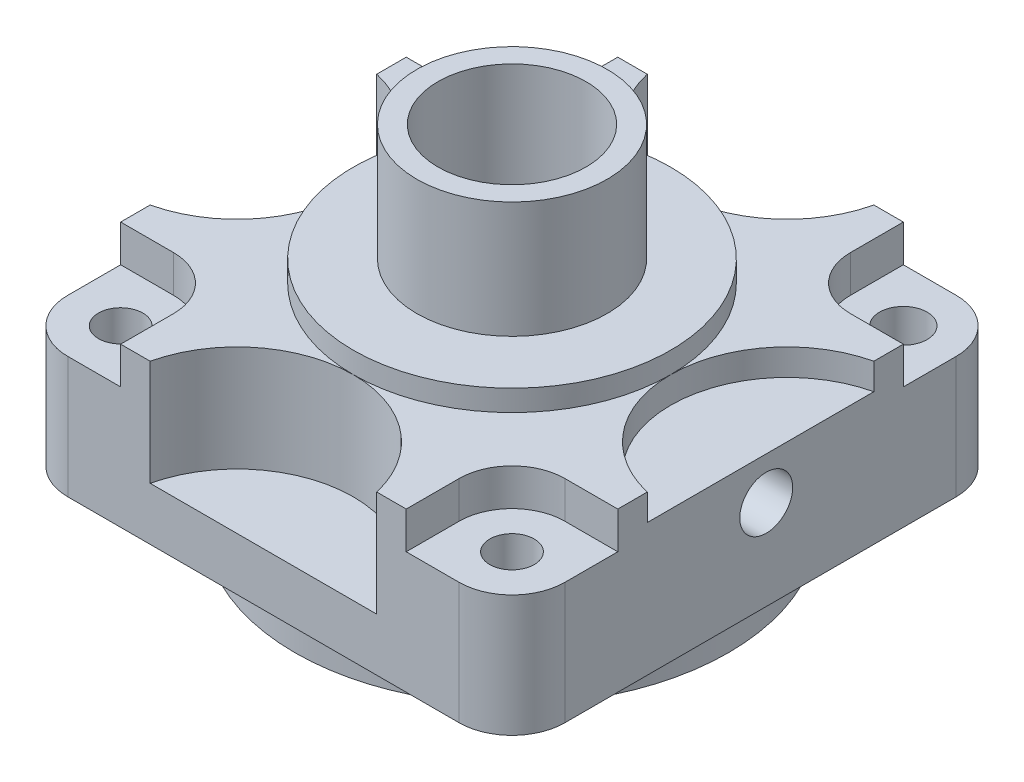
ISO-10303-21;
HEADER;
FILE_DESCRIPTION(('STEP AP214'),'2;1');
FILE_NAME('part.step','',(''),(''),'','','');
FILE_SCHEMA(('AUTOMOTIVE_DESIGN { 1 0 10303 214 1 1 1 1 }'));
ENDSEC;
DATA;
#1=APPLICATION_CONTEXT('core data for automotive mechanical design processes');
#2=APPLICATION_PROTOCOL_DEFINITION('international standard','automotive_design',2000,#1);
#3=PRODUCT_CONTEXT('',#1,'mechanical');
#4=PRODUCT('Part','Part','',(#3));
#5=PRODUCT_RELATED_PRODUCT_CATEGORY('part','',(#4));
#6=PRODUCT_DEFINITION_FORMATION('','',#4);
#7=PRODUCT_DEFINITION_CONTEXT('part definition',#1,'design');
#8=PRODUCT_DEFINITION('design','',#6,#7);
#9=PRODUCT_DEFINITION_SHAPE('','',#8);
#10=(LENGTH_UNIT() NAMED_UNIT(*) SI_UNIT(.MILLI.,.METRE.));
#11=(NAMED_UNIT(*) PLANE_ANGLE_UNIT() SI_UNIT($,.RADIAN.));
#12=(NAMED_UNIT(*) SI_UNIT($,.STERADIAN.) SOLID_ANGLE_UNIT());
#13=UNCERTAINTY_MEASURE_WITH_UNIT(LENGTH_MEASURE(1.E-05),#10,'distance_accuracy_value','');
#14=(GEOMETRIC_REPRESENTATION_CONTEXT(3) GLOBAL_UNCERTAINTY_ASSIGNED_CONTEXT((#13)) GLOBAL_UNIT_ASSIGNED_CONTEXT((#10,
#11,#12)) REPRESENTATION_CONTEXT('',''));
#15=CARTESIAN_POINT('',(0.,0.,0.));
#16=DIRECTION('',(0.,0.,1.));
#17=DIRECTION('',(1.,0.,0.));
#18=AXIS2_PLACEMENT_3D('',#15,#16,#17);
#19=CARTESIAN_POINT('',(-18.5,0.,42.));
#20=DIRECTION('',(0.,1.,0.));
#21=DIRECTION('',(-1.,0.,0.));
#22=AXIS2_PLACEMENT_3D('',#19,#20,#21);
#23=CYLINDRICAL_SURFACE('',#22,5.);
#24=DIRECTION('',(0.,-1.,0.));
#25=VECTOR('',#24,1.);
#26=CARTESIAN_POINT('',(-18.5,0.,47.));
#27=LINE('',#26,#25);
#28=CARTESIAN_POINT('',(-18.5,11.5,47.));
#29=VERTEX_POINT('',#28);
#30=CARTESIAN_POINT('',(-18.5,0.,47.));
#31=VERTEX_POINT('',#30);
#32=EDGE_CURVE('E536',#29,#31,#27,.T.);
#33=ORIENTED_EDGE('',*,*,#32,.F.);
#34=CARTESIAN_POINT('',(-18.5,11.5,42.));
#35=DIRECTION('',(0.,1.,0.));
#36=DIRECTION('',(0.,0.,1.));
#37=AXIS2_PLACEMENT_3D('',#34,#35,#36);
#38=CIRCLE('',#37,5.);
#39=CARTESIAN_POINT('',(-23.5,11.5,42.));
#40=VERTEX_POINT('',#39);
#41=EDGE_CURVE('E288',#40,#29,#38,.T.);
#42=ORIENTED_EDGE('',*,*,#41,.F.);
#43=DIRECTION('',(0.,-1.,0.));
#44=VECTOR('',#43,1.);
#45=CARTESIAN_POINT('',(-23.5,15.,42.));
#46=LINE('',#45,#44);
#47=CARTESIAN_POINT('',(-23.5,0.,42.));
#48=VERTEX_POINT('',#47);
#49=EDGE_CURVE('E548',#48,#40,#46,.F.);
#50=ORIENTED_EDGE('',*,*,#49,.F.);
#51=CARTESIAN_POINT('',(-18.5,0.,42.));
#52=DIRECTION('',(0.,1.,0.));
#53=DIRECTION('',(0.,0.,1.));
#54=AXIS2_PLACEMENT_3D('',#51,#52,#53);
#55=CIRCLE('',#54,5.);
#56=EDGE_CURVE('E544',#31,#48,#55,.F.);
#57=ORIENTED_EDGE('',*,*,#56,.F.);
#58=EDGE_LOOP('',(#33,#42,#50,#57));
#59=FACE_BOUND('',#58,.T.);
#60=ADVANCED_FACE('F34',(#59),#23,.T.);
#61=CARTESIAN_POINT('',(-18.5,-8.5,42.));
#62=DIRECTION('',(0.,1.,0.));
#63=DIRECTION('',(0.,0.,1.));
#64=AXIS2_PLACEMENT_3D('',#61,#62,#63);
#65=CYLINDRICAL_SURFACE('',#64,2.09999999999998);
#66=CARTESIAN_POINT('',(-18.5,0.,42.));
#67=DIRECTION('',(0.,1.,0.));
#68=DIRECTION('',(0.,0.,1.));
#69=AXIS2_PLACEMENT_3D('',#66,#67,#68);
#70=CIRCLE('',#69,2.09999999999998);
#71=CARTESIAN_POINT('',(-18.5,0.,44.1));
#72=VERTEX_POINT('',#71);
#73=EDGE_CURVE('E563',#72,#72,#70,.T.);
#74=ORIENTED_EDGE('',*,*,#73,.F.);
#75=EDGE_LOOP('',(#74));
#76=FACE_BOUND('',#75,.T.);
#77=CARTESIAN_POINT('',(-18.5,11.5,42.));
#78=DIRECTION('',(0.,1.,0.));
#79=DIRECTION('',(0.,0.,1.));
#80=AXIS2_PLACEMENT_3D('',#77,#78,#79);
#81=CIRCLE('',#80,2.09999999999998);
#82=CARTESIAN_POINT('',(-18.5,11.5,44.1));
#83=VERTEX_POINT('',#82);
#84=EDGE_CURVE('E38',#83,#83,#81,.F.);
#85=ORIENTED_EDGE('',*,*,#84,.F.);
#86=EDGE_LOOP('',(#85));
#87=FACE_BOUND('',#86,.T.);
#88=ADVANCED_FACE('F588',(#76,#87),#65,.F.);
#89=CARTESIAN_POINT('',(-18.5,15.,5.));
#90=DIRECTION('',(0.,-1.,0.));
#91=DIRECTION('',(1.,0.,0.));
#92=AXIS2_PLACEMENT_3D('',#89,#90,#91);
#93=CYLINDRICAL_SURFACE('',#92,5.);
#94=DIRECTION('',(0.,-1.,0.));
#95=VECTOR('',#94,1.);
#96=CARTESIAN_POINT('',(-23.5,15.,5.));
#97=LINE('',#96,#95);
#98=CARTESIAN_POINT('',(-23.5,11.5,5.));
#99=VERTEX_POINT('',#98);
#100=CARTESIAN_POINT('',(-23.5,0.,5.));
#101=VERTEX_POINT('',#100);
#102=EDGE_CURVE('E546',#99,#101,#97,.T.);
#103=ORIENTED_EDGE('',*,*,#102,.F.);
#104=CARTESIAN_POINT('',(-18.5,11.5,5.));
#105=DIRECTION('',(0.,1.,0.));
#106=DIRECTION('',(0.,0.,1.));
#107=AXIS2_PLACEMENT_3D('',#104,#105,#106);
#108=CIRCLE('',#107,5.);
#109=CARTESIAN_POINT('',(-18.5,11.5,0.));
#110=VERTEX_POINT('',#109);
#111=EDGE_CURVE('E307',#110,#99,#108,.T.);
#112=ORIENTED_EDGE('',*,*,#111,.F.);
#113=DIRECTION('',(0.,-1.,0.));
#114=VECTOR('',#113,1.);
#115=CARTESIAN_POINT('',(-18.5,0.,0.));
#116=LINE('',#115,#114);
#117=CARTESIAN_POINT('',(-18.5,0.,0.));
#118=VERTEX_POINT('',#117);
#119=EDGE_CURVE('E43',#118,#110,#116,.F.);
#120=ORIENTED_EDGE('',*,*,#119,.F.);
#121=CARTESIAN_POINT('',(-18.5,0.,5.));
#122=DIRECTION('',(0.,1.,0.));
#123=DIRECTION('',(0.,0.,1.));
#124=AXIS2_PLACEMENT_3D('',#121,#122,#123);
#125=CIRCLE('',#124,5.);
#126=EDGE_CURVE('E538',#101,#118,#125,.F.);
#127=ORIENTED_EDGE('',*,*,#126,.F.);
#128=EDGE_LOOP('',(#103,#112,#120,#127));
#129=FACE_BOUND('',#128,.T.);
#130=ADVANCED_FACE('F36',(#129),#93,.T.);
#131=CARTESIAN_POINT('',(-18.5,-8.5,5.));
#132=DIRECTION('',(0.,1.,0.));
#133=DIRECTION('',(0.,0.,1.));
#134=AXIS2_PLACEMENT_3D('',#131,#132,#133);
#135=CYLINDRICAL_SURFACE('',#134,2.1);
#136=CARTESIAN_POINT('',(-18.5,0.,5.));
#137=DIRECTION('',(0.,1.,0.));
#138=DIRECTION('',(0.,0.,1.));
#139=AXIS2_PLACEMENT_3D('',#136,#137,#138);
#140=CIRCLE('',#139,2.1);
#141=CARTESIAN_POINT('',(-18.5,0.,7.09999999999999));
#142=VERTEX_POINT('',#141);
#143=EDGE_CURVE('E566',#142,#142,#140,.T.);
#144=ORIENTED_EDGE('',*,*,#143,.F.);
#145=EDGE_LOOP('',(#144));
#146=FACE_BOUND('',#145,.T.);
#147=CARTESIAN_POINT('',(-18.5,11.5,5.));
#148=DIRECTION('',(0.,1.,0.));
#149=DIRECTION('',(0.,0.,1.));
#150=AXIS2_PLACEMENT_3D('',#147,#148,#149);
#151=CIRCLE('',#150,2.1);
#152=CARTESIAN_POINT('',(-18.5,11.5,7.09999999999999));
#153=VERTEX_POINT('',#152);
#154=EDGE_CURVE('E324',#153,#153,#151,.F.);
#155=ORIENTED_EDGE('',*,*,#154,.F.);
#156=EDGE_LOOP('',(#155));
#157=FACE_BOUND('',#156,.T.);
#158=ADVANCED_FACE('F577',(#146,#157),#135,.F.);
#159=CARTESIAN_POINT('',(18.5,15.,5.));
#160=DIRECTION('',(0.,1.,0.));
#161=DIRECTION('',(-1.,0.,0.));
#162=AXIS2_PLACEMENT_3D('',#159,#160,#161);
#163=CYLINDRICAL_SURFACE('',#162,5.);
#164=DIRECTION('',(0.,1.,0.));
#165=VECTOR('',#164,1.);
#166=CARTESIAN_POINT('',(18.5,0.,0.));
#167=LINE('',#166,#165);
#168=CARTESIAN_POINT('',(18.5,11.5,0.));
#169=VERTEX_POINT('',#168);
#170=CARTESIAN_POINT('',(18.5,0.,0.));
#171=VERTEX_POINT('',#170);
#172=EDGE_CURVE('E11',#169,#171,#167,.F.);
#173=ORIENTED_EDGE('',*,*,#172,.F.);
#174=CARTESIAN_POINT('',(18.5,11.5,5.));
#175=DIRECTION('',(0.,1.,0.));
#176=DIRECTION('',(0.,0.,1.));
#177=AXIS2_PLACEMENT_3D('',#174,#175,#176);
#178=CIRCLE('',#177,5.);
#179=CARTESIAN_POINT('',(23.5,11.5,5.));
#180=VERTEX_POINT('',#179);
#181=EDGE_CURVE('E340',#180,#169,#178,.T.);
#182=ORIENTED_EDGE('',*,*,#181,.F.);
#183=DIRECTION('',(0.,1.,0.));
#184=VECTOR('',#183,1.);
#185=CARTESIAN_POINT('',(23.5,15.,5.));
#186=LINE('',#185,#184);
#187=CARTESIAN_POINT('',(23.5,0.,5.));
#188=VERTEX_POINT('',#187);
#189=EDGE_CURVE('E551',#188,#180,#186,.T.);
#190=ORIENTED_EDGE('',*,*,#189,.F.);
#191=CARTESIAN_POINT('',(18.5,0.,5.));
#192=DIRECTION('',(0.,1.,0.));
#193=DIRECTION('',(0.,0.,1.));
#194=AXIS2_PLACEMENT_3D('',#191,#192,#193);
#195=CIRCLE('',#194,5.);
#196=EDGE_CURVE('E540',#171,#188,#195,.F.);
#197=ORIENTED_EDGE('',*,*,#196,.F.);
#198=EDGE_LOOP('',(#173,#182,#190,#197));
#199=FACE_BOUND('',#198,.T.);
#200=ADVANCED_FACE('F579',(#199),#163,.T.);
#201=CARTESIAN_POINT('',(18.5,-8.5,5.));
#202=DIRECTION('',(0.,1.,0.));
#203=DIRECTION('',(0.,0.,1.));
#204=AXIS2_PLACEMENT_3D('',#201,#202,#203);
#205=CYLINDRICAL_SURFACE('',#204,2.25);
#206=CARTESIAN_POINT('',(18.5,0.,5.));
#207=DIRECTION('',(0.,1.,0.));
#208=DIRECTION('',(0.,0.,1.));
#209=AXIS2_PLACEMENT_3D('',#206,#207,#208);
#210=CIRCLE('',#209,2.25);
#211=CARTESIAN_POINT('',(18.5,0.,7.25));
#212=VERTEX_POINT('',#211);
#213=EDGE_CURVE('E401',#212,#212,#210,.T.);
#214=ORIENTED_EDGE('',*,*,#213,.F.);
#215=EDGE_LOOP('',(#214));
#216=FACE_BOUND('',#215,.T.);
#217=CARTESIAN_POINT('',(18.5,11.5,5.));
#218=DIRECTION('',(0.,1.,0.));
#219=DIRECTION('',(0.,0.,1.));
#220=AXIS2_PLACEMENT_3D('',#217,#218,#219);
#221=CIRCLE('',#220,2.25);
#222=CARTESIAN_POINT('',(18.5,11.5,7.25));
#223=VERTEX_POINT('',#222);
#224=EDGE_CURVE('E357',#223,#223,#221,.F.);
#225=ORIENTED_EDGE('',*,*,#224,.F.);
#226=EDGE_LOOP('',(#225));
#227=FACE_BOUND('',#226,.T.);
#228=ADVANCED_FACE('F586',(#216,#227),#205,.F.);
#229=CARTESIAN_POINT('',(18.5,0.,42.));
#230=DIRECTION('',(0.,-1.,0.));
#231=DIRECTION('',(1.,0.,0.));
#232=AXIS2_PLACEMENT_3D('',#229,#230,#231);
#233=CYLINDRICAL_SURFACE('',#232,5.);
#234=DIRECTION('',(0.,1.,0.));
#235=VECTOR('',#234,1.);
#236=CARTESIAN_POINT('',(23.5,0.,42.));
#237=LINE('',#236,#235);
#238=CARTESIAN_POINT('',(23.5,11.5,42.));
#239=VERTEX_POINT('',#238);
#240=CARTESIAN_POINT('',(23.5,0.,42.));
#241=VERTEX_POINT('',#240);
#242=EDGE_CURVE('E554',#239,#241,#237,.F.);
#243=ORIENTED_EDGE('',*,*,#242,.F.);
#244=CARTESIAN_POINT('',(18.5,11.5,42.));
#245=DIRECTION('',(0.,1.,0.));
#246=DIRECTION('',(0.,0.,1.));
#247=AXIS2_PLACEMENT_3D('',#244,#245,#246);
#248=CIRCLE('',#247,5.);
#249=CARTESIAN_POINT('',(18.5,11.5,47.));
#250=VERTEX_POINT('',#249);
#251=EDGE_CURVE('E373',#250,#239,#248,.T.);
#252=ORIENTED_EDGE('',*,*,#251,.F.);
#253=DIRECTION('',(0.,1.,0.));
#254=VECTOR('',#253,1.);
#255=CARTESIAN_POINT('',(18.5,15.,47.));
#256=LINE('',#255,#254);
#257=CARTESIAN_POINT('',(18.5,0.,47.));
#258=VERTEX_POINT('',#257);
#259=EDGE_CURVE('E529',#258,#250,#256,.T.);
#260=ORIENTED_EDGE('',*,*,#259,.F.);
#261=CARTESIAN_POINT('',(18.5,0.,42.));
#262=DIRECTION('',(0.,1.,0.));
#263=DIRECTION('',(0.,0.,1.));
#264=AXIS2_PLACEMENT_3D('',#261,#262,#263);
#265=CIRCLE('',#264,5.);
#266=EDGE_CURVE('E542',#241,#258,#265,.F.);
#267=ORIENTED_EDGE('',*,*,#266,.F.);
#268=EDGE_LOOP('',(#243,#252,#260,#267));
#269=FACE_BOUND('',#268,.T.);
#270=ADVANCED_FACE('F605',(#269),#233,.T.);
#271=CARTESIAN_POINT('',(18.5,-8.5,42.));
#272=DIRECTION('',(0.,1.,0.));
#273=DIRECTION('',(0.,0.,1.));
#274=AXIS2_PLACEMENT_3D('',#271,#272,#273);
#275=CYLINDRICAL_SURFACE('',#274,2.09999999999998);
#276=CARTESIAN_POINT('',(18.5,0.,42.));
#277=DIRECTION('',(0.,1.,0.));
#278=DIRECTION('',(0.,0.,1.));
#279=AXIS2_PLACEMENT_3D('',#276,#277,#278);
#280=CIRCLE('',#279,2.09999999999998);
#281=CARTESIAN_POINT('',(18.5,0.,44.1));
#282=VERTEX_POINT('',#281);
#283=EDGE_CURVE('E560',#282,#282,#280,.T.);
#284=ORIENTED_EDGE('',*,*,#283,.F.);
#285=EDGE_LOOP('',(#284));
#286=FACE_BOUND('',#285,.T.);
#287=CARTESIAN_POINT('',(18.5,11.5,42.));
#288=DIRECTION('',(0.,1.,0.));
#289=DIRECTION('',(0.,0.,1.));
#290=AXIS2_PLACEMENT_3D('',#287,#288,#289);
#291=CIRCLE('',#290,2.09999999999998);
#292=CARTESIAN_POINT('',(18.5,11.5,44.1));
#293=VERTEX_POINT('',#292);
#294=EDGE_CURVE('E390',#293,#293,#291,.F.);
#295=ORIENTED_EDGE('',*,*,#294,.F.);
#296=EDGE_LOOP('',(#295));
#297=FACE_BOUND('',#296,.T.);
#298=ADVANCED_FACE('F607',(#286,#297),#275,.F.);
#299=CARTESIAN_POINT('',(-23.5,15.,47.));
#300=DIRECTION('',(0.,-1.,0.));
#301=DIRECTION('',(0.,0.,-1.));
#302=AXIS2_PLACEMENT_3D('',#299,#300,#301);
#303=PLANE('',#302);
#304=CARTESIAN_POINT('',(18.5,15.,42.));
#305=DIRECTION('',(0.,1.,0.));
#306=DIRECTION('',(0.,0.,1.));
#307=AXIS2_PLACEMENT_3D('',#304,#305,#306);
#308=CIRCLE('',#307,5.);
#309=CARTESIAN_POINT('',(18.5,15.,37.));
#310=VERTEX_POINT('',#309);
#311=CARTESIAN_POINT('',(13.5,15.,42.));
#312=VERTEX_POINT('',#311);
#313=EDGE_CURVE('E381',#310,#312,#308,.T.);
#314=ORIENTED_EDGE('',*,*,#313,.F.);
#315=DIRECTION('',(-1.,0.,0.));
#316=VECTOR('',#315,1.);
#317=CARTESIAN_POINT('',(18.5,15.,37.));
#318=LINE('',#317,#316);
#319=CARTESIAN_POINT('',(23.5,15.,37.));
#320=VERTEX_POINT('',#319);
#321=EDGE_CURVE('E368',#320,#310,#318,.T.);
#322=ORIENTED_EDGE('',*,*,#321,.F.);
#323=DIRECTION('',(0.,0.,-1.));
#324=VECTOR('',#323,1.);
#325=CARTESIAN_POINT('',(23.5,15.,47.));
#326=LINE('',#325,#324);
#327=CARTESIAN_POINT('',(23.5,15.,34.2121426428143));
#328=VERTEX_POINT('',#327);
#329=EDGE_CURVE('E513',#320,#328,#326,.T.);
#330=ORIENTED_EDGE('',*,*,#329,.T.);
#331=CARTESIAN_POINT('',(26.,15.,23.5));
#332=DIRECTION('',(0.,1.,0.));
#333=DIRECTION('',(0.,0.,1.));
#334=AXIS2_PLACEMENT_3D('',#331,#332,#333);
#335=CIRCLE('',#334,11.);
#336=CARTESIAN_POINT('',(15.,15.,23.5));
#337=VERTEX_POINT('',#336);
#338=EDGE_CURVE('E404',#337,#328,#335,.T.);
#339=ORIENTED_EDGE('',*,*,#338,.F.);
#340=CARTESIAN_POINT('',(0.,15.,23.5));
#341=DIRECTION('',(0.,-1.,0.));
#342=DIRECTION('',(0.,0.,-1.));
#343=AXIS2_PLACEMENT_3D('',#340,#341,#342);
#344=CIRCLE('',#343,15.);
#345=CARTESIAN_POINT('',(0.,15.,38.5));
#346=VERTEX_POINT('',#345);
#347=EDGE_CURVE('E531',#346,#337,#344,.F.);
#348=ORIENTED_EDGE('',*,*,#347,.F.);
#349=CARTESIAN_POINT('',(0.,15.,49.5));
#350=DIRECTION('',(0.,1.,0.));
#351=DIRECTION('',(0.,0.,1.));
#352=AXIS2_PLACEMENT_3D('',#349,#350,#351);
#353=CIRCLE('',#352,11.);
#354=CARTESIAN_POINT('',(10.7121426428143,15.,47.));
#355=VERTEX_POINT('',#354);
#356=EDGE_CURVE('E436',#355,#346,#353,.T.);
#357=ORIENTED_EDGE('',*,*,#356,.F.);
#358=DIRECTION('',(-1.,0.,0.));
#359=VECTOR('',#358,1.);
#360=CARTESIAN_POINT('',(-23.5,15.,47.));
#361=LINE('',#360,#359);
#362=CARTESIAN_POINT('',(13.5,15.,47.));
#363=VERTEX_POINT('',#362);
#364=EDGE_CURVE('E502',#363,#355,#361,.T.);
#365=ORIENTED_EDGE('',*,*,#364,.F.);
#366=DIRECTION('',(0.,0.,1.));
#367=VECTOR('',#366,1.);
#368=CARTESIAN_POINT('',(13.5,15.,42.));
#369=LINE('',#368,#367);
#370=EDGE_CURVE('E384',#312,#363,#369,.T.);
#371=ORIENTED_EDGE('',*,*,#370,.F.);
#372=EDGE_LOOP('',(#314,#322,#330,#339,#348,#357,#365,#371));
#373=FACE_BOUND('',#372,.T.);
#374=ADVANCED_FACE('F613',(#373),#303,.F.);
#375=CARTESIAN_POINT('',(-18.5,15.,5.));
#376=DIRECTION('',(0.,1.,0.));
#377=DIRECTION('',(0.,0.,1.));
#378=AXIS2_PLACEMENT_3D('',#375,#376,#377);
#379=CIRCLE('',#378,5.);
#380=CARTESIAN_POINT('',(-18.5,15.,9.99999999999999));
#381=VERTEX_POINT('',#380);
#382=CARTESIAN_POINT('',(-13.5,15.,5.));
#383=VERTEX_POINT('',#382);
#384=EDGE_CURVE('E315',#381,#383,#379,.T.);
#385=ORIENTED_EDGE('',*,*,#384,.F.);
#386=DIRECTION('',(1.,0.,0.));
#387=VECTOR('',#386,1.);
#388=CARTESIAN_POINT('',(-18.5,15.,9.99999999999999));
#389=LINE('',#388,#387);
#390=CARTESIAN_POINT('',(-23.5,15.,9.99999999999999));
#391=VERTEX_POINT('',#390);
#392=EDGE_CURVE('E304',#391,#381,#389,.T.);
#393=ORIENTED_EDGE('',*,*,#392,.F.);
#394=DIRECTION('',(0.,0.,-1.));
#395=VECTOR('',#394,1.);
#396=CARTESIAN_POINT('',(-23.5,15.,47.));
#397=LINE('',#396,#395);
#398=CARTESIAN_POINT('',(-23.5,15.,12.7878573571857));
#399=VERTEX_POINT('',#398);
#400=EDGE_CURVE('E504',#399,#391,#397,.T.);
#401=ORIENTED_EDGE('',*,*,#400,.F.);
#402=CARTESIAN_POINT('',(-26.,15.,23.5));
#403=DIRECTION('',(0.,1.,0.));
#404=DIRECTION('',(0.,0.,1.));
#405=AXIS2_PLACEMENT_3D('',#402,#403,#404);
#406=CIRCLE('',#405,11.);
#407=CARTESIAN_POINT('',(-15.,15.,23.5));
#408=VERTEX_POINT('',#407);
#409=EDGE_CURVE('E415',#408,#399,#406,.T.);
#410=ORIENTED_EDGE('',*,*,#409,.F.);
#411=CARTESIAN_POINT('',(0.,15.,8.5));
#412=VERTEX_POINT('',#411);
#413=EDGE_CURVE('E526',#412,#408,#344,.F.);
#414=ORIENTED_EDGE('',*,*,#413,.F.);
#415=CARTESIAN_POINT('',(0.,15.,-2.5));
#416=DIRECTION('',(0.,1.,0.));
#417=DIRECTION('',(0.,0.,1.));
#418=AXIS2_PLACEMENT_3D('',#415,#416,#417);
#419=CIRCLE('',#418,11.);
#420=CARTESIAN_POINT('',(-10.7121426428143,15.,0.));
#421=VERTEX_POINT('',#420);
#422=EDGE_CURVE('E451',#421,#412,#419,.T.);
#423=ORIENTED_EDGE('',*,*,#422,.F.);
#424=DIRECTION('',(-1.,0.,0.));
#425=VECTOR('',#424,1.);
#426=CARTESIAN_POINT('',(-23.5,15.,0.));
#427=LINE('',#426,#425);
#428=CARTESIAN_POINT('',(-13.5,15.,0.));
#429=VERTEX_POINT('',#428);
#430=EDGE_CURVE('E508',#421,#429,#427,.T.);
#431=ORIENTED_EDGE('',*,*,#430,.T.);
#432=DIRECTION('',(0.,0.,-1.));
#433=VECTOR('',#432,1.);
#434=CARTESIAN_POINT('',(-13.5,15.,5.));
#435=LINE('',#434,#433);
#436=EDGE_CURVE('E318',#383,#429,#435,.T.);
#437=ORIENTED_EDGE('',*,*,#436,.F.);
#438=EDGE_LOOP('',(#385,#393,#401,#410,#414,#423,#431,#437));
#439=FACE_BOUND('',#438,.T.);
#440=ADVANCED_FACE('F863',(#439),#303,.F.);
#441=CARTESIAN_POINT('',(18.5,15.,5.));
#442=DIRECTION('',(0.,1.,0.));
#443=DIRECTION('',(0.,0.,1.));
#444=AXIS2_PLACEMENT_3D('',#441,#442,#443);
#445=CIRCLE('',#444,4.99999999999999);
#446=CARTESIAN_POINT('',(13.5,15.,5.));
#447=VERTEX_POINT('',#446);
#448=CARTESIAN_POINT('',(18.5,15.,9.99999999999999));
#449=VERTEX_POINT('',#448);
#450=EDGE_CURVE('E348',#447,#449,#445,.T.);
#451=ORIENTED_EDGE('',*,*,#450,.F.);
#452=DIRECTION('',(0.,0.,1.));
#453=VECTOR('',#452,1.);
#454=CARTESIAN_POINT('',(13.5,15.,5.));
#455=LINE('',#454,#453);
#456=CARTESIAN_POINT('',(13.5,15.,0.));
#457=VERTEX_POINT('',#456);
#458=EDGE_CURVE('E335',#457,#447,#455,.T.);
#459=ORIENTED_EDGE('',*,*,#458,.F.);
#460=CARTESIAN_POINT('',(10.7121426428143,15.,0.));
#461=VERTEX_POINT('',#460);
#462=EDGE_CURVE('E501',#457,#461,#427,.T.);
#463=ORIENTED_EDGE('',*,*,#462,.T.);
#464=EDGE_CURVE('E445',#412,#461,#419,.T.);
#465=ORIENTED_EDGE('',*,*,#464,.F.);
#466=EDGE_CURVE('E525',#337,#412,#344,.F.);
#467=ORIENTED_EDGE('',*,*,#466,.F.);
#468=CARTESIAN_POINT('',(23.5,15.,12.7878573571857));
#469=VERTEX_POINT('',#468);
#470=EDGE_CURVE('E408',#469,#337,#335,.T.);
#471=ORIENTED_EDGE('',*,*,#470,.F.);
#472=CARTESIAN_POINT('',(23.5,15.,9.99999999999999));
#473=VERTEX_POINT('',#472);
#474=EDGE_CURVE('E512',#469,#473,#326,.T.);
#475=ORIENTED_EDGE('',*,*,#474,.T.);
#476=DIRECTION('',(1.,0.,0.));
#477=VECTOR('',#476,1.);
#478=CARTESIAN_POINT('',(18.5,15.,9.99999999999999));
#479=LINE('',#478,#477);
#480=EDGE_CURVE('E351',#449,#473,#479,.T.);
#481=ORIENTED_EDGE('',*,*,#480,.F.);
#482=EDGE_LOOP('',(#451,#459,#463,#465,#467,#471,#475,#481));
#483=FACE_BOUND('',#482,.T.);
#484=ADVANCED_FACE('F650',(#483),#303,.F.);
#485=CARTESIAN_POINT('',(0.,-8.5,23.5));
#486=DIRECTION('',(0.,1.,0.));
#487=DIRECTION('',(0.,0.,1.));
#488=AXIS2_PLACEMENT_3D('',#485,#486,#487);
#489=CYLINDRICAL_SURFACE('',#488,5.75);
#490=CARTESIAN_POINT('',(0.,15.,23.5));
#491=DIRECTION('',(0.,1.,0.));
#492=DIRECTION('',(0.,0.,1.));
#493=AXIS2_PLACEMENT_3D('',#490,#491,#492);
#494=CIRCLE('',#493,5.75);
#495=CARTESIAN_POINT('',(0.,15.,29.25));
#496=VERTEX_POINT('',#495);
#497=EDGE_CURVE('E469',#496,#496,#494,.T.);
#498=ORIENTED_EDGE('',*,*,#497,.T.);
#499=EDGE_LOOP('',(#498));
#500=FACE_BOUND('',#499,.T.);
#501=CARTESIAN_POINT('',(0.,8.5,23.5));
#502=DIRECTION('',(0.,-1.,0.));
#503=DIRECTION('',(1.,0.,0.));
#504=AXIS2_PLACEMENT_3D('',#501,#502,#503);
#505=CIRCLE('',#504,5.75);
#506=CARTESIAN_POINT('',(5.75,8.5,23.5));
#507=VERTEX_POINT('',#506);
#508=EDGE_CURVE('E466',#507,#507,#505,.F.);
#509=ORIENTED_EDGE('',*,*,#508,.F.);
#510=EDGE_LOOP('',(#509));
#511=FACE_BOUND('',#510,.T.);
#512=ADVANCED_FACE('F709',(#500,#511),#489,.F.);
#513=CARTESIAN_POINT('',(0.,17.,23.5));
#514=DIRECTION('',(0.,1.,0.));
#515=DIRECTION('',(0.,0.,1.));
#516=AXIS2_PLACEMENT_3D('',#513,#514,#515);
#517=PLANE('',#516);
#518=CARTESIAN_POINT('',(0.,17.,23.5));
#519=DIRECTION('',(0.,1.,0.));
#520=DIRECTION('',(0.,0.,1.));
#521=AXIS2_PLACEMENT_3D('',#518,#519,#520);
#522=CIRCLE('',#521,15.);
#523=CARTESIAN_POINT('',(0.,17.,38.5));
#524=VERTEX_POINT('',#523);
#525=EDGE_CURVE('E482',#524,#524,#522,.T.);
#526=ORIENTED_EDGE('',*,*,#525,.T.);
#527=EDGE_LOOP('',(#526));
#528=FACE_BOUND('',#527,.T.);
#529=CARTESIAN_POINT('',(0.,17.,23.5));
#530=DIRECTION('',(0.,1.,0.));
#531=DIRECTION('',(0.,0.,1.));
#532=AXIS2_PLACEMENT_3D('',#529,#530,#531);
#533=CIRCLE('',#532,8.99999999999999);
#534=CARTESIAN_POINT('',(0.,17.,32.5));
#535=VERTEX_POINT('',#534);
#536=EDGE_CURVE('E476',#535,#535,#533,.T.);
#537=ORIENTED_EDGE('',*,*,#536,.F.);
#538=EDGE_LOOP('',(#537));
#539=FACE_BOUND('',#538,.T.);
#540=ADVANCED_FACE('F712',(#528,#539),#517,.T.);
#541=CARTESIAN_POINT('',(-18.5,15.,42.));
#542=DIRECTION('',(0.,1.,0.));
#543=DIRECTION('',(0.,0.,1.));
#544=AXIS2_PLACEMENT_3D('',#541,#542,#543);
#545=CIRCLE('',#544,5.);
#546=CARTESIAN_POINT('',(-13.5,15.,42.));
#547=VERTEX_POINT('',#546);
#548=CARTESIAN_POINT('',(-18.5,15.,37.));
#549=VERTEX_POINT('',#548);
#550=EDGE_CURVE('E268',#547,#549,#545,.T.);
#551=ORIENTED_EDGE('',*,*,#550,.F.);
#552=DIRECTION('',(0.,0.,-1.));
#553=VECTOR('',#552,1.);
#554=CARTESIAN_POINT('',(-13.5,15.,42.));
#555=LINE('',#554,#553);
#556=CARTESIAN_POINT('',(-13.5,15.,47.));
#557=VERTEX_POINT('',#556);
#558=EDGE_CURVE('E281',#557,#547,#555,.T.);
#559=ORIENTED_EDGE('',*,*,#558,.F.);
#560=CARTESIAN_POINT('',(-10.7121426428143,15.,47.));
#561=VERTEX_POINT('',#560);
#562=EDGE_CURVE('E500',#561,#557,#361,.T.);
#563=ORIENTED_EDGE('',*,*,#562,.F.);
#564=EDGE_CURVE('E430',#346,#561,#353,.T.);
#565=ORIENTED_EDGE('',*,*,#564,.F.);
#566=EDGE_CURVE('E530',#408,#346,#344,.F.);
#567=ORIENTED_EDGE('',*,*,#566,.F.);
#568=CARTESIAN_POINT('',(-23.5,15.,34.2121426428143));
#569=VERTEX_POINT('',#568);
#570=EDGE_CURVE('E421',#569,#408,#406,.T.);
#571=ORIENTED_EDGE('',*,*,#570,.F.);
#572=CARTESIAN_POINT('',(-23.5,15.,37.));
#573=VERTEX_POINT('',#572);
#574=EDGE_CURVE('E510',#573,#569,#397,.T.);
#575=ORIENTED_EDGE('',*,*,#574,.F.);
#576=DIRECTION('',(-1.,0.,0.));
#577=VECTOR('',#576,1.);
#578=CARTESIAN_POINT('',(-18.5,15.,37.));
#579=LINE('',#578,#577);
#580=EDGE_CURVE('E284',#549,#573,#579,.T.);
#581=ORIENTED_EDGE('',*,*,#580,.F.);
#582=EDGE_LOOP('',(#551,#559,#563,#565,#567,#571,#575,#581));
#583=FACE_BOUND('',#582,.T.);
#584=ADVANCED_FACE('F732',(#583),#303,.F.);
#585=CARTESIAN_POINT('',(0.,-5.,23.5284931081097));
#586=DIRECTION('',(0.,-1.,0.));
#587=DIRECTION('',(1.,0.,0.));
#588=AXIS2_PLACEMENT_3D('',#585,#586,#587);
#589=PLANE('',#588);
#590=CARTESIAN_POINT('',(0.,-5.,23.5284931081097));
#591=DIRECTION('',(0.,-1.,0.));
#592=DIRECTION('',(1.,0.,0.));
#593=AXIS2_PLACEMENT_3D('',#590,#591,#592);
#594=CIRCLE('',#593,20.5);
#595=CARTESIAN_POINT('',(20.5,-5.,23.5284931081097));
#596=VERTEX_POINT('',#595);
#597=EDGE_CURVE('E491',#596,#596,#594,.T.);
#598=ORIENTED_EDGE('',*,*,#597,.T.);
#599=EDGE_LOOP('',(#598));
#600=FACE_BOUND('',#599,.T.);
#601=CARTESIAN_POINT('',(0.,-5.,23.5284931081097));
#602=DIRECTION('',(0.,-1.,0.));
#603=DIRECTION('',(1.,0.,0.));
#604=AXIS2_PLACEMENT_3D('',#601,#602,#603);
#605=CIRCLE('',#604,9.75);
#606=CARTESIAN_POINT('',(9.75,-5.,23.5284931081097));
#607=VERTEX_POINT('',#606);
#608=EDGE_CURVE('E487',#607,#607,#605,.T.);
#609=ORIENTED_EDGE('',*,*,#608,.F.);
#610=EDGE_LOOP('',(#609));
#611=FACE_BOUND('',#610,.T.);
#612=ADVANCED_FACE('F746',(#600,#611),#589,.T.);
#613=CARTESIAN_POINT('',(-23.5,0.,47.));
#614=DIRECTION('',(0.,1.,0.));
#615=DIRECTION('',(0.,0.,1.));
#616=AXIS2_PLACEMENT_3D('',#613,#614,#615);
#617=PLANE('',#616);
#618=ORIENTED_EDGE('',*,*,#143,.T.);
#619=EDGE_LOOP('',(#618));
#620=FACE_BOUND('',#619,.T.);
#621=ORIENTED_EDGE('',*,*,#73,.T.);
#622=EDGE_LOOP('',(#621));
#623=FACE_BOUND('',#622,.T.);
#624=ORIENTED_EDGE('',*,*,#283,.T.);
#625=EDGE_LOOP('',(#624));
#626=FACE_BOUND('',#625,.T.);
#627=ORIENTED_EDGE('',*,*,#213,.T.);
#628=EDGE_LOOP('',(#627));
#629=FACE_BOUND('',#628,.T.);
#630=DIRECTION('',(1.,0.,0.));
#631=VECTOR('',#630,1.);
#632=CARTESIAN_POINT('',(-23.5,0.,47.));
#633=LINE('',#632,#631);
#634=EDGE_CURVE('E497',#31,#258,#633,.T.);
#635=ORIENTED_EDGE('',*,*,#634,.F.);
#636=ORIENTED_EDGE('',*,*,#56,.T.);
#637=DIRECTION('',(0.,0.,-1.));
#638=VECTOR('',#637,1.);
#639=CARTESIAN_POINT('',(-23.5,0.,47.));
#640=LINE('',#639,#638);
#641=EDGE_CURVE('E519',#48,#101,#640,.T.);
#642=ORIENTED_EDGE('',*,*,#641,.T.);
#643=ORIENTED_EDGE('',*,*,#126,.T.);
#644=DIRECTION('',(1.,0.,0.));
#645=VECTOR('',#644,1.);
#646=CARTESIAN_POINT('',(-23.5,0.,0.));
#647=LINE('',#646,#645);
#648=EDGE_CURVE('E496',#118,#171,#647,.T.);
#649=ORIENTED_EDGE('',*,*,#648,.T.);
#650=ORIENTED_EDGE('',*,*,#196,.T.);
#651=DIRECTION('',(0.,0.,-1.));
#652=VECTOR('',#651,1.);
#653=CARTESIAN_POINT('',(23.5,0.,47.));
#654=LINE('',#653,#652);
#655=EDGE_CURVE('E515',#241,#188,#654,.T.);
#656=ORIENTED_EDGE('',*,*,#655,.F.);
#657=ORIENTED_EDGE('',*,*,#266,.T.);
#658=EDGE_LOOP('',(#635,#636,#642,#643,#649,#650,#656,#657));
#659=FACE_BOUND('',#658,.T.);
#660=CARTESIAN_POINT('',(0.,0.,23.5284931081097));
#661=DIRECTION('',(0.,1.,0.));
#662=DIRECTION('',(0.,0.,1.));
#663=AXIS2_PLACEMENT_3D('',#660,#661,#662);
#664=CIRCLE('',#663,20.5);
#665=CARTESIAN_POINT('',(0.,0.,44.0284931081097));
#666=VERTEX_POINT('',#665);
#667=EDGE_CURVE('E522',#666,#666,#664,.F.);
#668=ORIENTED_EDGE('',*,*,#667,.F.);
#669=EDGE_LOOP('',(#668));
#670=FACE_BOUND('',#669,.T.);
#671=ADVANCED_FACE('F631',(#620,#623,#626,#629,#659,#670),#617,.F.);
#672=CARTESIAN_POINT('',(-23.5,15.,47.));
#673=DIRECTION('',(1.,0.,0.));
#674=DIRECTION('',(0.,1.,0.));
#675=AXIS2_PLACEMENT_3D('',#672,#673,#674);
#676=PLANE('',#675);
#677=DIRECTION('',(0.,0.,1.));
#678=VECTOR('',#677,1.);
#679=CARTESIAN_POINT('',(-23.5,11.5,37.));
#680=LINE('',#679,#678);
#681=CARTESIAN_POINT('',(-23.5,11.5,37.));
#682=VERTEX_POINT('',#681);
#683=EDGE_CURVE('E51',#682,#40,#680,.T.);
#684=ORIENTED_EDGE('',*,*,#683,.F.);
#685=DIRECTION('',(0.,1.,0.));
#686=VECTOR('',#685,1.);
#687=CARTESIAN_POINT('',(-23.5,11.5,37.));
#688=LINE('',#687,#686);
#689=EDGE_CURVE('E271',#682,#573,#688,.T.);
#690=ORIENTED_EDGE('',*,*,#689,.T.);
#691=ORIENTED_EDGE('',*,*,#574,.T.);
#692=DIRECTION('',(0.,1.,0.));
#693=VECTOR('',#692,1.);
#694=CARTESIAN_POINT('',(-23.5,4.99999999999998,34.2121426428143));
#695=LINE('',#694,#693);
#696=CARTESIAN_POINT('',(-23.5,4.99999999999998,34.2121426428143));
#697=VERTEX_POINT('',#696);
#698=EDGE_CURVE('E427',#697,#569,#695,.T.);
#699=ORIENTED_EDGE('',*,*,#698,.F.);
#700=DIRECTION('',(0.,0.,1.));
#701=VECTOR('',#700,1.);
#702=CARTESIAN_POINT('',(-23.5,4.99999999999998,12.7878573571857));
#703=LINE('',#702,#701);
#704=CARTESIAN_POINT('',(-23.5,4.99999999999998,12.7878573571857));
#705=VERTEX_POINT('',#704);
#706=EDGE_CURVE('E420',#705,#697,#703,.T.);
#707=ORIENTED_EDGE('',*,*,#706,.F.);
#708=DIRECTION('',(0.,1.,0.));
#709=VECTOR('',#708,1.);
#710=CARTESIAN_POINT('',(-23.5,4.99999999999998,12.7878573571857));
#711=LINE('',#710,#709);
#712=EDGE_CURVE('E425',#705,#399,#711,.T.);
#713=ORIENTED_EDGE('',*,*,#712,.T.);
#714=ORIENTED_EDGE('',*,*,#400,.T.);
#715=DIRECTION('',(0.,1.,0.));
#716=VECTOR('',#715,1.);
#717=CARTESIAN_POINT('',(-23.5,11.5,9.99999999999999));
#718=LINE('',#717,#716);
#719=CARTESIAN_POINT('',(-23.5,11.5,9.99999999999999));
#720=VERTEX_POINT('',#719);
#721=EDGE_CURVE('E325',#720,#391,#718,.T.);
#722=ORIENTED_EDGE('',*,*,#721,.F.);
#723=DIRECTION('',(0.,0.,1.));
#724=VECTOR('',#723,1.);
#725=CARTESIAN_POINT('',(-23.5,11.5,9.99999999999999));
#726=LINE('',#725,#724);
#727=EDGE_CURVE('E309',#99,#720,#726,.T.);
#728=ORIENTED_EDGE('',*,*,#727,.F.);
#729=ORIENTED_EDGE('',*,*,#102,.T.);
#730=ORIENTED_EDGE('',*,*,#641,.F.);
#731=ORIENTED_EDGE('',*,*,#49,.T.);
#732=EDGE_LOOP('',(#684,#690,#691,#699,#707,#713,#714,#722,#728,#729,#730,#731));
#733=FACE_BOUND('',#732,.T.);
#734=ADVANCED_FACE('F603',(#733),#676,.F.);
#735=CARTESIAN_POINT('',(23.5,15.,47.));
#736=DIRECTION('',(-1.,0.,0.));
#737=DIRECTION('',(0.,-1.,0.));
#738=AXIS2_PLACEMENT_3D('',#735,#736,#737);
#739=PLANE('',#738);
#740=CARTESIAN_POINT('',(23.5,8.49999999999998,22.9619250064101));
#741=DIRECTION('',(1.,0.,0.));
#742=DIRECTION('',(0.,0.,-1.));
#743=AXIS2_PLACEMENT_3D('',#740,#741,#742);
#744=CIRCLE('',#743,2.49999999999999);
#745=CARTESIAN_POINT('',(23.5,8.49999999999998,20.4619250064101));
#746=VERTEX_POINT('',#745);
#747=EDGE_CURVE('E400',#746,#746,#744,.T.);
#748=ORIENTED_EDGE('',*,*,#747,.F.);
#749=EDGE_LOOP('',(#748));
#750=FACE_BOUND('',#749,.T.);
#751=DIRECTION('',(0.,0.,-1.));
#752=VECTOR('',#751,1.);
#753=CARTESIAN_POINT('',(23.5,11.5,9.99999999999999));
#754=LINE('',#753,#752);
#755=CARTESIAN_POINT('',(23.5,11.5,9.99999999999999));
#756=VERTEX_POINT('',#755);
#757=EDGE_CURVE('E338',#756,#180,#754,.T.);
#758=ORIENTED_EDGE('',*,*,#757,.F.);
#759=DIRECTION('',(0.,1.,0.));
#760=VECTOR('',#759,1.);
#761=CARTESIAN_POINT('',(23.5,11.5,9.99999999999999));
#762=LINE('',#761,#760);
#763=EDGE_CURVE('E360',#756,#473,#762,.T.);
#764=ORIENTED_EDGE('',*,*,#763,.T.);
#765=ORIENTED_EDGE('',*,*,#474,.F.);
#766=DIRECTION('',(0.,1.,0.));
#767=VECTOR('',#766,1.);
#768=CARTESIAN_POINT('',(23.5,12.5,12.7878573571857));
#769=LINE('',#768,#767);
#770=CARTESIAN_POINT('',(23.5,12.5,12.7878573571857));
#771=VERTEX_POINT('',#770);
#772=EDGE_CURVE('E413',#771,#469,#769,.T.);
#773=ORIENTED_EDGE('',*,*,#772,.F.);
#774=DIRECTION('',(0.,0.,-1.));
#775=VECTOR('',#774,1.);
#776=CARTESIAN_POINT('',(23.5,12.5,12.7878573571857));
#777=LINE('',#776,#775);
#778=CARTESIAN_POINT('',(23.5,12.5,34.2121426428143));
#779=VERTEX_POINT('',#778);
#780=EDGE_CURVE('E407',#779,#771,#777,.T.);
#781=ORIENTED_EDGE('',*,*,#780,.F.);
#782=DIRECTION('',(0.,1.,0.));
#783=VECTOR('',#782,1.);
#784=CARTESIAN_POINT('',(23.5,12.5,34.2121426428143));
#785=LINE('',#784,#783);
#786=EDGE_CURVE('E411',#779,#328,#785,.T.);
#787=ORIENTED_EDGE('',*,*,#786,.T.);
#788=ORIENTED_EDGE('',*,*,#329,.F.);
#789=DIRECTION('',(0.,1.,0.));
#790=VECTOR('',#789,1.);
#791=CARTESIAN_POINT('',(23.5,11.5,37.));
#792=LINE('',#791,#790);
#793=CARTESIAN_POINT('',(23.5,11.5,37.));
#794=VERTEX_POINT('',#793);
#795=EDGE_CURVE('E391',#794,#320,#792,.T.);
#796=ORIENTED_EDGE('',*,*,#795,.F.);
#797=DIRECTION('',(0.,0.,-1.));
#798=VECTOR('',#797,1.);
#799=CARTESIAN_POINT('',(23.5,11.5,37.));
#800=LINE('',#799,#798);
#801=EDGE_CURVE('E375',#239,#794,#800,.T.);
#802=ORIENTED_EDGE('',*,*,#801,.F.);
#803=ORIENTED_EDGE('',*,*,#242,.T.);
#804=ORIENTED_EDGE('',*,*,#655,.T.);
#805=ORIENTED_EDGE('',*,*,#189,.T.);
#806=EDGE_LOOP('',(#758,#764,#765,#773,#781,#787,#788,#796,#802,#803,#804,#805));
#807=FACE_BOUND('',#806,.T.);
#808=ADVANCED_FACE('F626',(#750,#807),#739,.F.);
#809=CARTESIAN_POINT('',(-23.5,0.,47.));
#810=DIRECTION('',(0.,0.,1.));
#811=DIRECTION('',(1.,0.,0.));
#812=AXIS2_PLACEMENT_3D('',#809,#810,#811);
#813=PLANE('',#812);
#814=DIRECTION('',(0.,1.,0.));
#815=VECTOR('',#814,1.);
#816=CARTESIAN_POINT('',(-13.5,11.5,47.));
#817=LINE('',#816,#815);
#818=CARTESIAN_POINT('',(-13.5,11.5,47.));
#819=VERTEX_POINT('',#818);
#820=EDGE_CURVE('E297',#819,#557,#817,.T.);
#821=ORIENTED_EDGE('',*,*,#820,.F.);
#822=DIRECTION('',(1.,0.,0.));
#823=VECTOR('',#822,1.);
#824=CARTESIAN_POINT('',(-13.5,11.5,47.));
#825=LINE('',#824,#823);
#826=EDGE_CURVE('E290',#29,#819,#825,.T.);
#827=ORIENTED_EDGE('',*,*,#826,.F.);
#828=ORIENTED_EDGE('',*,*,#32,.T.);
#829=ORIENTED_EDGE('',*,*,#634,.T.);
#830=ORIENTED_EDGE('',*,*,#259,.T.);
#831=DIRECTION('',(1.,0.,0.));
#832=VECTOR('',#831,1.);
#833=CARTESIAN_POINT('',(13.5,11.5,47.));
#834=LINE('',#833,#832);
#835=CARTESIAN_POINT('',(13.5,11.5,47.));
#836=VERTEX_POINT('',#835);
#837=EDGE_CURVE('E371',#836,#250,#834,.T.);
#838=ORIENTED_EDGE('',*,*,#837,.F.);
#839=DIRECTION('',(0.,1.,0.));
#840=VECTOR('',#839,1.);
#841=CARTESIAN_POINT('',(13.5,11.5,47.));
#842=LINE('',#841,#840);
#843=EDGE_CURVE('E393',#836,#363,#842,.T.);
#844=ORIENTED_EDGE('',*,*,#843,.T.);
#845=ORIENTED_EDGE('',*,*,#364,.T.);
#846=DIRECTION('',(0.,1.,0.));
#847=VECTOR('',#846,1.);
#848=CARTESIAN_POINT('',(10.7121426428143,4.99999999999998,47.));
#849=LINE('',#848,#847);
#850=CARTESIAN_POINT('',(10.7121426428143,4.99999999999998,47.));
#851=VERTEX_POINT('',#850);
#852=EDGE_CURVE('E442',#851,#355,#849,.T.);
#853=ORIENTED_EDGE('',*,*,#852,.F.);
#854=DIRECTION('',(1.,0.,0.));
#855=VECTOR('',#854,1.);
#856=CARTESIAN_POINT('',(10.7121426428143,4.99999999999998,47.));
#857=LINE('',#856,#855);
#858=CARTESIAN_POINT('',(-10.7121426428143,4.99999999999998,47.));
#859=VERTEX_POINT('',#858);
#860=EDGE_CURVE('E435',#859,#851,#857,.T.);
#861=ORIENTED_EDGE('',*,*,#860,.F.);
#862=DIRECTION('',(0.,1.,0.));
#863=VECTOR('',#862,1.);
#864=CARTESIAN_POINT('',(-10.7121426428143,4.99999999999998,47.));
#865=LINE('',#864,#863);
#866=EDGE_CURVE('E439',#859,#561,#865,.T.);
#867=ORIENTED_EDGE('',*,*,#866,.T.);
#868=ORIENTED_EDGE('',*,*,#562,.T.);
#869=EDGE_LOOP('',(#821,#827,#828,#829,#830,#838,#844,#845,#853,#861,#867,#868));
#870=FACE_BOUND('',#869,.T.);
#871=ADVANCED_FACE('F754',(#870),#813,.T.);
#872=CARTESIAN_POINT('',(-23.5,0.,0.));
#873=DIRECTION('',(0.,0.,1.));
#874=DIRECTION('',(1.,0.,0.));
#875=AXIS2_PLACEMENT_3D('',#872,#873,#874);
#876=PLANE('',#875);
#877=DIRECTION('',(-1.,0.,0.));
#878=VECTOR('',#877,1.);
#879=CARTESIAN_POINT('',(-13.5,11.5,0.));
#880=LINE('',#879,#878);
#881=CARTESIAN_POINT('',(-13.5,11.5,0.));
#882=VERTEX_POINT('',#881);
#883=EDGE_CURVE('E59',#882,#110,#880,.T.);
#884=ORIENTED_EDGE('',*,*,#883,.F.);
#885=DIRECTION('',(0.,1.,0.));
#886=VECTOR('',#885,1.);
#887=CARTESIAN_POINT('',(-13.5,11.5,0.));
#888=LINE('',#887,#886);
#889=EDGE_CURVE('E327',#882,#429,#888,.T.);
#890=ORIENTED_EDGE('',*,*,#889,.T.);
#891=ORIENTED_EDGE('',*,*,#430,.F.);
#892=DIRECTION('',(0.,1.,0.));
#893=VECTOR('',#892,1.);
#894=CARTESIAN_POINT('',(-10.7121426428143,4.99999999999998,0.));
#895=LINE('',#894,#893);
#896=CARTESIAN_POINT('',(-10.7121426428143,4.99999999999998,0.));
#897=VERTEX_POINT('',#896);
#898=EDGE_CURVE('E458',#897,#421,#895,.T.);
#899=ORIENTED_EDGE('',*,*,#898,.F.);
#900=DIRECTION('',(-1.,0.,0.));
#901=VECTOR('',#900,1.);
#902=CARTESIAN_POINT('',(10.7121426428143,4.99999999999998,0.));
#903=LINE('',#902,#901);
#904=CARTESIAN_POINT('',(10.7121426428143,4.99999999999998,0.));
#905=VERTEX_POINT('',#904);
#906=EDGE_CURVE('E450',#905,#897,#903,.T.);
#907=ORIENTED_EDGE('',*,*,#906,.F.);
#908=DIRECTION('',(0.,1.,0.));
#909=VECTOR('',#908,1.);
#910=CARTESIAN_POINT('',(10.7121426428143,4.99999999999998,0.));
#911=LINE('',#910,#909);
#912=EDGE_CURVE('E455',#905,#461,#911,.T.);
#913=ORIENTED_EDGE('',*,*,#912,.T.);
#914=ORIENTED_EDGE('',*,*,#462,.F.);
#915=DIRECTION('',(0.,1.,0.));
#916=VECTOR('',#915,1.);
#917=CARTESIAN_POINT('',(13.5,11.5,0.));
#918=LINE('',#917,#916);
#919=CARTESIAN_POINT('',(13.5,11.5,0.));
#920=VERTEX_POINT('',#919);
#921=EDGE_CURVE('E358',#920,#457,#918,.T.);
#922=ORIENTED_EDGE('',*,*,#921,.F.);
#923=DIRECTION('',(-1.,0.,0.));
#924=VECTOR('',#923,1.);
#925=CARTESIAN_POINT('',(13.5,11.5,0.));
#926=LINE('',#925,#924);
#927=EDGE_CURVE('E342',#169,#920,#926,.T.);
#928=ORIENTED_EDGE('',*,*,#927,.F.);
#929=ORIENTED_EDGE('',*,*,#172,.T.);
#930=ORIENTED_EDGE('',*,*,#648,.F.);
#931=ORIENTED_EDGE('',*,*,#119,.T.);
#932=EDGE_LOOP('',(#884,#890,#891,#899,#907,#913,#914,#922,#928,#929,#930,#931));
#933=FACE_BOUND('',#932,.T.);
#934=ADVANCED_FACE('F752',(#933),#876,.F.);
#935=CARTESIAN_POINT('',(0.,-5.,23.5284931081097));
#936=DIRECTION('',(0.,1.,0.));
#937=DIRECTION('',(-1.,0.,0.));
#938=AXIS2_PLACEMENT_3D('',#935,#936,#937);
#939=CYLINDRICAL_SURFACE('',#938,20.5);
#940=ORIENTED_EDGE('',*,*,#597,.F.);
#941=EDGE_LOOP('',(#940));
#942=FACE_BOUND('',#941,.T.);
#943=ORIENTED_EDGE('',*,*,#667,.T.);
#944=EDGE_LOOP('',(#943));
#945=FACE_BOUND('',#944,.T.);
#946=ADVANCED_FACE('F744',(#942,#945),#939,.T.);
#947=CARTESIAN_POINT('',(0.,-8.5,23.5284931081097));
#948=DIRECTION('',(0.,1.,0.));
#949=DIRECTION('',(-1.,0.,0.));
#950=AXIS2_PLACEMENT_3D('',#947,#948,#949);
#951=CYLINDRICAL_SURFACE('',#950,9.75);
#952=CARTESIAN_POINT('',(0.,-8.5,23.5284931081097));
#953=DIRECTION('',(0.,-1.,0.));
#954=DIRECTION('',(1.,0.,0.));
#955=AXIS2_PLACEMENT_3D('',#952,#953,#954);
#956=CIRCLE('',#955,9.75);
#957=CARTESIAN_POINT('',(9.75,-8.5,23.5284931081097));
#958=VERTEX_POINT('',#957);
#959=EDGE_CURVE('E488',#958,#958,#956,.T.);
#960=ORIENTED_EDGE('',*,*,#959,.F.);
#961=EDGE_LOOP('',(#960));
#962=FACE_BOUND('',#961,.T.);
#963=ORIENTED_EDGE('',*,*,#608,.T.);
#964=EDGE_LOOP('',(#963));
#965=FACE_BOUND('',#964,.T.);
#966=ADVANCED_FACE('F740',(#962,#965),#951,.T.);
#967=CARTESIAN_POINT('',(0.,-8.5,23.5284931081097));
#968=DIRECTION('',(0.,-1.,0.));
#969=DIRECTION('',(1.,0.,0.));
#970=AXIS2_PLACEMENT_3D('',#967,#968,#969);
#971=PLANE('',#970);
#972=CARTESIAN_POINT('',(0.,-8.5,23.5284931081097));
#973=DIRECTION('',(0.,-1.,0.));
#974=DIRECTION('',(1.,0.,0.));
#975=AXIS2_PLACEMENT_3D('',#972,#973,#974);
#976=CIRCLE('',#975,8.25);
#977=CARTESIAN_POINT('',(8.25000000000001,-8.5,23.5284931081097));
#978=VERTEX_POINT('',#977);
#979=EDGE_CURVE('E460',#978,#978,#976,.T.);
#980=ORIENTED_EDGE('',*,*,#979,.F.);
#981=EDGE_LOOP('',(#980));
#982=FACE_BOUND('',#981,.T.);
#983=ORIENTED_EDGE('',*,*,#959,.T.);
#984=EDGE_LOOP('',(#983));
#985=FACE_BOUND('',#984,.T.);
#986=ADVANCED_FACE('F736',(#982,#985),#971,.T.);
#987=CARTESIAN_POINT('',(0.,17.,23.5));
#988=DIRECTION('',(0.,-1.,0.));
#989=DIRECTION('',(0.,0.,-1.));
#990=AXIS2_PLACEMENT_3D('',#987,#988,#989);
#991=CYLINDRICAL_SURFACE('',#990,15.);
#992=ORIENTED_EDGE('',*,*,#525,.F.);
#993=EDGE_LOOP('',(#992));
#994=FACE_BOUND('',#993,.T.);
#995=ORIENTED_EDGE('',*,*,#413,.T.);
#996=ORIENTED_EDGE('',*,*,#566,.T.);
#997=ORIENTED_EDGE('',*,*,#347,.T.);
#998=ORIENTED_EDGE('',*,*,#466,.T.);
#999=EDGE_LOOP('',(#995,#996,#997,#998));
#1000=FACE_BOUND('',#999,.T.);
#1001=ADVANCED_FACE('F728',(#994,#1000),#991,.T.);
#1002=CARTESIAN_POINT('',(0.,28.,23.5));
#1003=DIRECTION('',(0.,-1.,0.));
#1004=DIRECTION('',(0.,0.,-1.));
#1005=AXIS2_PLACEMENT_3D('',#1002,#1003,#1004);
#1006=CYLINDRICAL_SURFACE('',#1005,8.99999999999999);
#1007=CARTESIAN_POINT('',(0.,28.,23.5));
#1008=DIRECTION('',(0.,1.,0.));
#1009=DIRECTION('',(0.,0.,1.));
#1010=AXIS2_PLACEMENT_3D('',#1007,#1008,#1009);
#1011=CIRCLE('',#1010,8.99999999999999);
#1012=CARTESIAN_POINT('',(0.,28.,32.5));
#1013=VERTEX_POINT('',#1012);
#1014=EDGE_CURVE('E479',#1013,#1013,#1011,.T.);
#1015=ORIENTED_EDGE('',*,*,#1014,.F.);
#1016=EDGE_LOOP('',(#1015));
#1017=FACE_BOUND('',#1016,.T.);
#1018=ORIENTED_EDGE('',*,*,#536,.T.);
#1019=EDGE_LOOP('',(#1018));
#1020=FACE_BOUND('',#1019,.T.);
#1021=ADVANCED_FACE('F724',(#1017,#1020),#1006,.T.);
#1022=CARTESIAN_POINT('',(0.,28.,23.5));
#1023=DIRECTION('',(0.,1.,0.));
#1024=DIRECTION('',(0.,0.,1.));
#1025=AXIS2_PLACEMENT_3D('',#1022,#1023,#1024);
#1026=PLANE('',#1025);
#1027=CARTESIAN_POINT('',(0.,28.,23.5));
#1028=DIRECTION('',(0.,1.,0.));
#1029=DIRECTION('',(0.,0.,1.));
#1030=AXIS2_PLACEMENT_3D('',#1027,#1028,#1029);
#1031=CIRCLE('',#1030,7.);
#1032=CARTESIAN_POINT('',(0.,28.,30.5));
#1033=VERTEX_POINT('',#1032);
#1034=EDGE_CURVE('E472',#1033,#1033,#1031,.T.);
#1035=ORIENTED_EDGE('',*,*,#1034,.F.);
#1036=EDGE_LOOP('',(#1035));
#1037=FACE_BOUND('',#1036,.T.);
#1038=ORIENTED_EDGE('',*,*,#1014,.T.);
#1039=EDGE_LOOP('',(#1038));
#1040=FACE_BOUND('',#1039,.T.);
#1041=ADVANCED_FACE('F720',(#1037,#1040),#1026,.T.);
#1042=CARTESIAN_POINT('',(0.,15.,23.5));
#1043=DIRECTION('',(0.,1.,0.));
#1044=DIRECTION('',(0.,0.,1.));
#1045=AXIS2_PLACEMENT_3D('',#1042,#1043,#1044);
#1046=CYLINDRICAL_SURFACE('',#1045,7.);
#1047=CARTESIAN_POINT('',(0.,15.,23.5));
#1048=DIRECTION('',(0.,1.,0.));
#1049=DIRECTION('',(0.,0.,1.));
#1050=AXIS2_PLACEMENT_3D('',#1047,#1048,#1049);
#1051=CIRCLE('',#1050,7.);
#1052=CARTESIAN_POINT('',(0.,15.,30.5));
#1053=VERTEX_POINT('',#1052);
#1054=EDGE_CURVE('E473',#1053,#1053,#1051,.T.);
#1055=CARTESIAN_POINT('',(0.,15.,30.5));
#1056=CARTESIAN_POINT('',(0.,15.1354166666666,30.5));
#1057=CARTESIAN_POINT('',(0.,15.2708333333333,30.5));
#1058=CARTESIAN_POINT('',(0.,15.5416666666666,30.5));
#1059=CARTESIAN_POINT('',(0.,15.6770833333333,30.5));
#1060=CARTESIAN_POINT('',(0.,15.9479166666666,30.5));
#1061=CARTESIAN_POINT('',(0.,16.0833333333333,30.5));
#1062=CARTESIAN_POINT('',(0.,16.3541666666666,30.5));
#1063=CARTESIAN_POINT('',(0.,16.4895833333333,30.5));
#1064=CARTESIAN_POINT('',(0.,16.7604166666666,30.5));
#1065=CARTESIAN_POINT('',(0.,16.8958333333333,30.5));
#1066=CARTESIAN_POINT('',(0.,17.1666666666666,30.5));
#1067=CARTESIAN_POINT('',(0.,17.3020833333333,30.5));
#1068=CARTESIAN_POINT('',(0.,17.5729166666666,30.5));
#1069=CARTESIAN_POINT('',(0.,17.7083333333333,30.5));
#1070=CARTESIAN_POINT('',(0.,17.9791666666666,30.5));
#1071=CARTESIAN_POINT('',(0.,18.1145833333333,30.5));
#1072=CARTESIAN_POINT('',(0.,18.3854166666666,30.5));
#1073=CARTESIAN_POINT('',(0.,18.5208333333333,30.5));
#1074=CARTESIAN_POINT('',(0.,18.7916666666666,30.5));
#1075=CARTESIAN_POINT('',(0.,18.9270833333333,30.5));
#1076=CARTESIAN_POINT('',(0.,19.1979166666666,30.5));
#1077=CARTESIAN_POINT('',(0.,19.3333333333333,30.5));
#1078=CARTESIAN_POINT('',(0.,19.6041666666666,30.5));
#1079=CARTESIAN_POINT('',(0.,19.7395833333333,30.5));
#1080=CARTESIAN_POINT('',(0.,20.0104166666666,30.5));
#1081=CARTESIAN_POINT('',(0.,20.1458333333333,30.5));
#1082=CARTESIAN_POINT('',(0.,20.4166666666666,30.5));
#1083=CARTESIAN_POINT('',(0.,20.5520833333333,30.5));
#1084=CARTESIAN_POINT('',(0.,20.8229166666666,30.5));
#1085=CARTESIAN_POINT('',(0.,20.9583333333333,30.5));
#1086=CARTESIAN_POINT('',(0.,21.2291666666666,30.5));
#1087=CARTESIAN_POINT('',(0.,21.3645833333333,30.5));
#1088=CARTESIAN_POINT('',(0.,21.6354166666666,30.5));
#1089=CARTESIAN_POINT('',(0.,21.7708333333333,30.5));
#1090=CARTESIAN_POINT('',(0.,22.0416666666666,30.5));
#1091=CARTESIAN_POINT('',(0.,22.1770833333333,30.5));
#1092=CARTESIAN_POINT('',(0.,22.4479166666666,30.5));
#1093=CARTESIAN_POINT('',(0.,22.5833333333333,30.5));
#1094=CARTESIAN_POINT('',(0.,22.8541666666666,30.5));
#1095=CARTESIAN_POINT('',(0.,22.9895833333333,30.5));
#1096=CARTESIAN_POINT('',(0.,23.2604166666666,30.5));
#1097=CARTESIAN_POINT('',(0.,23.3958333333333,30.5));
#1098=CARTESIAN_POINT('',(0.,23.6666666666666,30.5));
#1099=CARTESIAN_POINT('',(0.,23.8020833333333,30.5));
#1100=CARTESIAN_POINT('',(0.,24.0729166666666,30.5));
#1101=CARTESIAN_POINT('',(0.,24.2083333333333,30.5));
#1102=CARTESIAN_POINT('',(0.,24.4791666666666,30.5));
#1103=CARTESIAN_POINT('',(0.,24.6145833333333,30.5));
#1104=CARTESIAN_POINT('',(0.,24.8854166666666,30.5));
#1105=CARTESIAN_POINT('',(0.,25.0208333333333,30.5));
#1106=CARTESIAN_POINT('',(0.,25.2916666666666,30.5));
#1107=CARTESIAN_POINT('',(0.,25.4270833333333,30.5));
#1108=CARTESIAN_POINT('',(0.,25.6979166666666,30.5));
#1109=CARTESIAN_POINT('',(0.,25.8333333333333,30.5));
#1110=CARTESIAN_POINT('',(0.,26.1041666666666,30.5));
#1111=CARTESIAN_POINT('',(0.,26.2395833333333,30.5));
#1112=CARTESIAN_POINT('',(0.,26.5104166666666,30.5));
#1113=CARTESIAN_POINT('',(0.,26.6458333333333,30.5));
#1114=CARTESIAN_POINT('',(0.,26.9166666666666,30.5));
#1115=CARTESIAN_POINT('',(0.,27.0520833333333,30.5));
#1116=CARTESIAN_POINT('',(0.,27.3229166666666,30.5));
#1117=CARTESIAN_POINT('',(0.,27.4583333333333,30.5));
#1118=CARTESIAN_POINT('',(0.,27.7291666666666,30.5));
#1119=CARTESIAN_POINT('',(0.,27.8645833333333,30.5));
#1120=CARTESIAN_POINT('',(0.,28.,30.5));
#1121=B_SPLINE_CURVE_WITH_KNOTS('',3,(#1055,#1056,#1057,#1058,#1059,#1060,#1061,#1062,#1063,
#1064,#1065,#1066,#1067,#1068,#1069,#1070,#1071,#1072,#1073,#1074,#1075,#1076,#1077,#1078,#1079,
#1080,#1081,#1082,#1083,#1084,#1085,#1086,#1087,#1088,#1089,#1090,#1091,#1092,#1093,#1094,#1095,
#1096,#1097,#1098,#1099,#1100,#1101,#1102,#1103,#1104,#1105,#1106,#1107,#1108,#1109,#1110,#1111,
#1112,#1113,#1114,#1115,#1116,#1117,#1118,#1119,#1120),.UNSPECIFIED.,.F.,.F.,(4,2,2,2,2,2,2,2,2,
2,2,2,2,2,2,2,2,2,2,2,2,2,2,2,2,2,2,2,2,2,2,2,4),(0.,0.40625,0.812500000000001,1.21875,1.625,
2.03125,2.4375,2.84375,3.25,3.65625,4.0625,4.46875,4.875,5.28125,5.6875,6.09375,6.5,6.90625,
7.3125,7.71875,8.125,8.53125,8.9375,9.34375,9.75,10.15625,10.5625,10.96875,11.375,11.78125,
12.1875,12.59375,13.),.UNSPECIFIED.);
#1122=EDGE_CURVE('BSEAM716',#1053,#1033,#1121,.T.);
#1123=ORIENTED_EDGE('',*,*,#1054,.F.);
#1124=ORIENTED_EDGE('',*,*,#1034,.T.);
#1125=ORIENTED_EDGE('',*,*,#1122,.T.);
#1126=ORIENTED_EDGE('',*,*,#1122,.F.);
#1127=EDGE_LOOP('',(#1123,#1125,#1124,#1126));
#1128=FACE_BOUND('',#1127,.T.);
#1129=ADVANCED_FACE('F716',(#1128),#1046,.F.);
#1130=CARTESIAN_POINT('',(0.,15.,23.5));
#1131=DIRECTION('',(0.,1.,0.));
#1132=DIRECTION('',(0.,0.,1.));
#1133=AXIS2_PLACEMENT_3D('',#1130,#1131,#1132);
#1134=PLANE('',#1133);
#1135=ORIENTED_EDGE('',*,*,#497,.F.);
#1136=EDGE_LOOP('',(#1135));
#1137=FACE_BOUND('',#1136,.T.);
#1138=ORIENTED_EDGE('',*,*,#1054,.T.);
#1139=EDGE_LOOP('',(#1138));
#1140=FACE_BOUND('',#1139,.T.);
#1141=ADVANCED_FACE('F704',(#1137,#1140),#1134,.T.);
#1142=CARTESIAN_POINT('',(0.,8.5,23.5284931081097));
#1143=DIRECTION('',(0.,-1.,0.));
#1144=DIRECTION('',(1.,0.,0.));
#1145=AXIS2_PLACEMENT_3D('',#1142,#1143,#1144);
#1146=PLANE('',#1145);
#1147=CARTESIAN_POINT('',(0.,8.5,23.5284931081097));
#1148=DIRECTION('',(0.,-1.,0.));
#1149=DIRECTION('',(1.,0.,0.));
#1150=AXIS2_PLACEMENT_3D('',#1147,#1148,#1149);
#1151=CIRCLE('',#1150,8.25);
#1152=CARTESIAN_POINT('',(8.25000000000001,8.5,23.5284931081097));
#1153=VERTEX_POINT('',#1152);
#1154=EDGE_CURVE('E463',#1153,#1153,#1151,.T.);
#1155=ORIENTED_EDGE('',*,*,#1154,.T.);
#1156=EDGE_LOOP('',(#1155));
#1157=FACE_BOUND('',#1156,.T.);
#1158=ORIENTED_EDGE('',*,*,#508,.T.);
#1159=EDGE_LOOP('',(#1158));
#1160=FACE_BOUND('',#1159,.T.);
#1161=ADVANCED_FACE('F701',(#1157,#1160),#1146,.T.);
#1162=CARTESIAN_POINT('',(0.,8.5,23.5284931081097));
#1163=DIRECTION('',(0.,-1.,0.));
#1164=DIRECTION('',(1.,0.,0.));
#1165=AXIS2_PLACEMENT_3D('',#1162,#1163,#1164);
#1166=CYLINDRICAL_SURFACE('',#1165,8.25);
#1167=ORIENTED_EDGE('',*,*,#1154,.F.);
#1168=EDGE_LOOP('',(#1167));
#1169=FACE_BOUND('',#1168,.T.);
#1170=ORIENTED_EDGE('',*,*,#979,.T.);
#1171=EDGE_LOOP('',(#1170));
#1172=FACE_BOUND('',#1171,.T.);
#1173=ADVANCED_FACE('F699',(#1169,#1172),#1166,.F.);
#1174=CARTESIAN_POINT('',(0.,4.99999999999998,-2.5));
#1175=DIRECTION('',(0.,1.,0.));
#1176=DIRECTION('',(0.,0.,1.));
#1177=AXIS2_PLACEMENT_3D('',#1174,#1175,#1176);
#1178=CYLINDRICAL_SURFACE('',#1177,11.);
#1179=ORIENTED_EDGE('',*,*,#422,.T.);
#1180=ORIENTED_EDGE('',*,*,#464,.T.);
#1181=ORIENTED_EDGE('',*,*,#912,.F.);
#1182=CARTESIAN_POINT('',(0.,4.99999999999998,-2.5));
#1183=DIRECTION('',(0.,1.,0.));
#1184=DIRECTION('',(0.,0.,1.));
#1185=AXIS2_PLACEMENT_3D('',#1182,#1183,#1184);
#1186=CIRCLE('',#1185,11.);
#1187=EDGE_CURVE('E448',#897,#905,#1186,.T.);
#1188=ORIENTED_EDGE('',*,*,#1187,.F.);
#1189=ORIENTED_EDGE('',*,*,#898,.T.);
#1190=EDGE_LOOP('',(#1179,#1180,#1181,#1188,#1189));
#1191=FACE_BOUND('',#1190,.T.);
#1192=ADVANCED_FACE('F695',(#1191),#1178,.F.);
#1193=CARTESIAN_POINT('',(0.,4.99999999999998,-2.5));
#1194=DIRECTION('',(0.,1.,0.));
#1195=DIRECTION('',(0.,0.,1.));
#1196=AXIS2_PLACEMENT_3D('',#1193,#1194,#1195);
#1197=PLANE('',#1196);
#1198=ORIENTED_EDGE('',*,*,#1187,.T.);
#1199=ORIENTED_EDGE('',*,*,#906,.T.);
#1200=EDGE_LOOP('',(#1198,#1199));
#1201=FACE_BOUND('',#1200,.T.);
#1202=ADVANCED_FACE('F691',(#1201),#1197,.T.);
#1203=CARTESIAN_POINT('',(0.,4.99999999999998,49.5));
#1204=DIRECTION('',(0.,1.,0.));
#1205=DIRECTION('',(0.,0.,1.));
#1206=AXIS2_PLACEMENT_3D('',#1203,#1204,#1205);
#1207=CYLINDRICAL_SURFACE('',#1206,11.);
#1208=ORIENTED_EDGE('',*,*,#356,.T.);
#1209=ORIENTED_EDGE('',*,*,#564,.T.);
#1210=ORIENTED_EDGE('',*,*,#866,.F.);
#1211=CARTESIAN_POINT('',(0.,4.99999999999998,49.5));
#1212=DIRECTION('',(0.,1.,0.));
#1213=DIRECTION('',(0.,0.,1.));
#1214=AXIS2_PLACEMENT_3D('',#1211,#1212,#1213);
#1215=CIRCLE('',#1214,11.);
#1216=EDGE_CURVE('E433',#851,#859,#1215,.T.);
#1217=ORIENTED_EDGE('',*,*,#1216,.F.);
#1218=ORIENTED_EDGE('',*,*,#852,.T.);
#1219=EDGE_LOOP('',(#1208,#1209,#1210,#1217,#1218));
#1220=FACE_BOUND('',#1219,.T.);
#1221=ADVANCED_FACE('F687',(#1220),#1207,.F.);
#1222=CARTESIAN_POINT('',(0.,4.99999999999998,49.5));
#1223=DIRECTION('',(0.,1.,0.));
#1224=DIRECTION('',(0.,0.,1.));
#1225=AXIS2_PLACEMENT_3D('',#1222,#1223,#1224);
#1226=PLANE('',#1225);
#1227=ORIENTED_EDGE('',*,*,#1216,.T.);
#1228=ORIENTED_EDGE('',*,*,#860,.T.);
#1229=EDGE_LOOP('',(#1227,#1228));
#1230=FACE_BOUND('',#1229,.T.);
#1231=ADVANCED_FACE('F683',(#1230),#1226,.T.);
#1232=CARTESIAN_POINT('',(-26.,4.99999999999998,23.5));
#1233=DIRECTION('',(0.,1.,0.));
#1234=DIRECTION('',(0.,0.,1.));
#1235=AXIS2_PLACEMENT_3D('',#1232,#1233,#1234);
#1236=CYLINDRICAL_SURFACE('',#1235,11.);
#1237=ORIENTED_EDGE('',*,*,#570,.T.);
#1238=ORIENTED_EDGE('',*,*,#409,.T.);
#1239=ORIENTED_EDGE('',*,*,#712,.F.);
#1240=CARTESIAN_POINT('',(-26.,4.99999999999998,23.5));
#1241=DIRECTION('',(0.,1.,0.));
#1242=DIRECTION('',(0.,0.,1.));
#1243=AXIS2_PLACEMENT_3D('',#1240,#1241,#1242);
#1244=CIRCLE('',#1243,11.);
#1245=EDGE_CURVE('E418',#697,#705,#1244,.T.);
#1246=ORIENTED_EDGE('',*,*,#1245,.F.);
#1247=ORIENTED_EDGE('',*,*,#698,.T.);
#1248=EDGE_LOOP('',(#1237,#1238,#1239,#1246,#1247));
#1249=FACE_BOUND('',#1248,.T.);
#1250=ADVANCED_FACE('F679',(#1249),#1236,.F.);
#1251=CARTESIAN_POINT('',(-26.,4.99999999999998,23.5));
#1252=DIRECTION('',(0.,1.,0.));
#1253=DIRECTION('',(0.,0.,1.));
#1254=AXIS2_PLACEMENT_3D('',#1251,#1252,#1253);
#1255=PLANE('',#1254);
#1256=ORIENTED_EDGE('',*,*,#1245,.T.);
#1257=ORIENTED_EDGE('',*,*,#706,.T.);
#1258=EDGE_LOOP('',(#1256,#1257));
#1259=FACE_BOUND('',#1258,.T.);
#1260=ADVANCED_FACE('F673',(#1259),#1255,.T.);
#1261=CARTESIAN_POINT('',(26.,12.5,23.5));
#1262=DIRECTION('',(0.,1.,0.));
#1263=DIRECTION('',(0.,0.,1.));
#1264=AXIS2_PLACEMENT_3D('',#1261,#1262,#1263);
#1265=CYLINDRICAL_SURFACE('',#1264,11.);
#1266=ORIENTED_EDGE('',*,*,#470,.T.);
#1267=ORIENTED_EDGE('',*,*,#338,.T.);
#1268=ORIENTED_EDGE('',*,*,#786,.F.);
#1269=CARTESIAN_POINT('',(26.,12.5,23.5));
#1270=DIRECTION('',(0.,1.,0.));
#1271=DIRECTION('',(0.,0.,1.));
#1272=AXIS2_PLACEMENT_3D('',#1269,#1270,#1271);
#1273=CIRCLE('',#1272,11.);
#1274=EDGE_CURVE('E405',#771,#779,#1273,.T.);
#1275=ORIENTED_EDGE('',*,*,#1274,.F.);
#1276=ORIENTED_EDGE('',*,*,#772,.T.);
#1277=EDGE_LOOP('',(#1266,#1267,#1268,#1275,#1276));
#1278=FACE_BOUND('',#1277,.T.);
#1279=ADVANCED_FACE('F657',(#1278),#1265,.F.);
#1280=CARTESIAN_POINT('',(26.,12.5,23.5));
#1281=DIRECTION('',(0.,1.,0.));
#1282=DIRECTION('',(0.,0.,1.));
#1283=AXIS2_PLACEMENT_3D('',#1280,#1281,#1282);
#1284=PLANE('',#1283);
#1285=ORIENTED_EDGE('',*,*,#1274,.T.);
#1286=ORIENTED_EDGE('',*,*,#780,.T.);
#1287=EDGE_LOOP('',(#1285,#1286));
#1288=FACE_BOUND('',#1287,.T.);
#1289=ADVANCED_FACE('F662',(#1288),#1284,.T.);
#1290=CARTESIAN_POINT('',(23.5,8.49999999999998,22.9619250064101));
#1291=DIRECTION('',(1.,0.,0.));
#1292=DIRECTION('',(0.,0.,-1.));
#1293=AXIS2_PLACEMENT_3D('',#1290,#1291,#1292);
#1294=CYLINDRICAL_SURFACE('',#1293,2.49999999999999);
#1295=CARTESIAN_POINT('',(12.5,8.49999999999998,22.9619250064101));
#1296=DIRECTION('',(1.,0.,0.));
#1297=DIRECTION('',(0.,0.,-1.));
#1298=AXIS2_PLACEMENT_3D('',#1295,#1296,#1297);
#1299=CIRCLE('',#1298,2.49999999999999);
#1300=CARTESIAN_POINT('',(12.5,8.49999999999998,20.4619250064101));
#1301=VERTEX_POINT('',#1300);
#1302=EDGE_CURVE('E397',#1301,#1301,#1299,.T.);
#1303=ORIENTED_EDGE('',*,*,#1302,.F.);
#1304=EDGE_LOOP('',(#1303));
#1305=FACE_BOUND('',#1304,.T.);
#1306=ORIENTED_EDGE('',*,*,#747,.T.);
#1307=EDGE_LOOP('',(#1306));
#1308=FACE_BOUND('',#1307,.T.);
#1309=ADVANCED_FACE('F664',(#1305,#1308),#1294,.F.);
#1310=CARTESIAN_POINT('',(12.5,8.49999999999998,22.9619250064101));
#1311=DIRECTION('',(1.,0.,0.));
#1312=DIRECTION('',(0.,0.,-1.));
#1313=AXIS2_PLACEMENT_3D('',#1310,#1311,#1312);
#1314=CONICAL_SURFACE('',#1313,2.49999999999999,1.02974425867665);
#1315=CARTESIAN_POINT('',(10.9978484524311,8.49999999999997,22.9619250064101));
#1316=VERTEX_POINT('',#1315);
#1317=VERTEX_LOOP('',#1316);
#1318=FACE_BOUND('',#1317,.T.);
#1319=ORIENTED_EDGE('',*,*,#1302,.T.);
#1320=EDGE_LOOP('',(#1319));
#1321=FACE_BOUND('',#1320,.T.);
#1322=ADVANCED_FACE('F670',(#1318,#1321),#1314,.F.);
#1323=CARTESIAN_POINT('',(18.5,11.5,42.));
#1324=DIRECTION('',(0.,1.,0.));
#1325=DIRECTION('',(0.,0.,1.));
#1326=AXIS2_PLACEMENT_3D('',#1323,#1324,#1325);
#1327=PLANE('',#1326);
#1328=CARTESIAN_POINT('',(18.5,11.5,42.));
#1329=DIRECTION('',(0.,1.,0.));
#1330=DIRECTION('',(0.,0.,1.));
#1331=AXIS2_PLACEMENT_3D('',#1328,#1329,#1330);
#1332=CIRCLE('',#1331,5.);
#1333=CARTESIAN_POINT('',(18.5,11.5,37.));
#1334=VERTEX_POINT('',#1333);
#1335=CARTESIAN_POINT('',(13.5,11.5,42.));
#1336=VERTEX_POINT('',#1335);
#1337=EDGE_CURVE('E364',#1334,#1336,#1332,.T.);
#1338=ORIENTED_EDGE('',*,*,#1337,.T.);
#1339=DIRECTION('',(0.,0.,1.));
#1340=VECTOR('',#1339,1.);
#1341=CARTESIAN_POINT('',(13.5,11.5,42.));
#1342=LINE('',#1341,#1340);
#1343=EDGE_CURVE('E367',#1336,#836,#1342,.T.);
#1344=ORIENTED_EDGE('',*,*,#1343,.T.);
#1345=ORIENTED_EDGE('',*,*,#837,.T.);
#1346=ORIENTED_EDGE('',*,*,#251,.T.);
#1347=ORIENTED_EDGE('',*,*,#801,.T.);
#1348=DIRECTION('',(-1.,0.,0.));
#1349=VECTOR('',#1348,1.);
#1350=CARTESIAN_POINT('',(18.5,11.5,37.));
#1351=LINE('',#1350,#1349);
#1352=EDGE_CURVE('E377',#794,#1334,#1351,.T.);
#1353=ORIENTED_EDGE('',*,*,#1352,.T.);
#1354=EDGE_LOOP('',(#1338,#1344,#1345,#1346,#1347,#1353));
#1355=FACE_BOUND('',#1354,.T.);
#1356=ORIENTED_EDGE('',*,*,#294,.T.);
#1357=EDGE_LOOP('',(#1356));
#1358=FACE_BOUND('',#1357,.T.);
#1359=ADVANCED_FACE('F803',(#1355,#1358),#1327,.T.);
#1360=CARTESIAN_POINT('',(18.5,11.5,42.));
#1361=DIRECTION('',(0.,1.,0.));
#1362=DIRECTION('',(0.,0.,1.));
#1363=AXIS2_PLACEMENT_3D('',#1360,#1361,#1362);
#1364=CYLINDRICAL_SURFACE('',#1363,5.);
#1365=ORIENTED_EDGE('',*,*,#313,.T.);
#1366=DIRECTION('',(0.,1.,0.));
#1367=VECTOR('',#1366,1.);
#1368=CARTESIAN_POINT('',(13.5,11.5,42.));
#1369=LINE('',#1368,#1367);
#1370=EDGE_CURVE('E380',#1336,#312,#1369,.T.);
#1371=ORIENTED_EDGE('',*,*,#1370,.F.);
#1372=ORIENTED_EDGE('',*,*,#1337,.F.);
#1373=DIRECTION('',(0.,1.,0.));
#1374=VECTOR('',#1373,1.);
#1375=CARTESIAN_POINT('',(18.5,11.5,37.));
#1376=LINE('',#1375,#1374);
#1377=EDGE_CURVE('E388',#1334,#310,#1376,.T.);
#1378=ORIENTED_EDGE('',*,*,#1377,.T.);
#1379=EDGE_LOOP('',(#1365,#1371,#1372,#1378));
#1380=FACE_BOUND('',#1379,.T.);
#1381=ADVANCED_FACE('F806',(#1380),#1364,.F.);
#1382=CARTESIAN_POINT('',(18.5,11.5,37.));
#1383=DIRECTION('',(0.,0.,-1.));
#1384=DIRECTION('',(-1.,0.,0.));
#1385=AXIS2_PLACEMENT_3D('',#1382,#1383,#1384);
#1386=PLANE('',#1385);
#1387=ORIENTED_EDGE('',*,*,#321,.T.);
#1388=ORIENTED_EDGE('',*,*,#1377,.F.);
#1389=ORIENTED_EDGE('',*,*,#1352,.F.);
#1390=ORIENTED_EDGE('',*,*,#795,.T.);
#1391=EDGE_LOOP('',(#1387,#1388,#1389,#1390));
#1392=FACE_BOUND('',#1391,.T.);
#1393=ADVANCED_FACE('F791',(#1392),#1386,.F.);
#1394=CARTESIAN_POINT('',(13.5,11.5,42.));
#1395=DIRECTION('',(-1.,0.,0.));
#1396=DIRECTION('',(0.,0.,1.));
#1397=AXIS2_PLACEMENT_3D('',#1394,#1395,#1396);
#1398=PLANE('',#1397);
#1399=ORIENTED_EDGE('',*,*,#370,.T.);
#1400=ORIENTED_EDGE('',*,*,#843,.F.);
#1401=ORIENTED_EDGE('',*,*,#1343,.F.);
#1402=ORIENTED_EDGE('',*,*,#1370,.T.);
#1403=EDGE_LOOP('',(#1399,#1400,#1401,#1402));
#1404=FACE_BOUND('',#1403,.T.);
#1405=ADVANCED_FACE('F782',(#1404),#1398,.F.);
#1406=CARTESIAN_POINT('',(18.5,11.5,5.));
#1407=DIRECTION('',(0.,1.,0.));
#1408=DIRECTION('',(0.,0.,1.));
#1409=AXIS2_PLACEMENT_3D('',#1406,#1407,#1408);
#1410=PLANE('',#1409);
#1411=CARTESIAN_POINT('',(18.5,11.5,5.));
#1412=DIRECTION('',(0.,1.,0.));
#1413=DIRECTION('',(0.,0.,1.));
#1414=AXIS2_PLACEMENT_3D('',#1411,#1412,#1413);
#1415=CIRCLE('',#1414,4.99999999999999);
#1416=CARTESIAN_POINT('',(13.5,11.5,5.));
#1417=VERTEX_POINT('',#1416);
#1418=CARTESIAN_POINT('',(18.5,11.5,9.99999999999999));
#1419=VERTEX_POINT('',#1418);
#1420=EDGE_CURVE('E331',#1417,#1419,#1415,.T.);
#1421=ORIENTED_EDGE('',*,*,#1420,.T.);
#1422=DIRECTION('',(1.,0.,0.));
#1423=VECTOR('',#1422,1.);
#1424=CARTESIAN_POINT('',(18.5,11.5,9.99999999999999));
#1425=LINE('',#1424,#1423);
#1426=EDGE_CURVE('E334',#1419,#756,#1425,.T.);
#1427=ORIENTED_EDGE('',*,*,#1426,.T.);
#1428=ORIENTED_EDGE('',*,*,#757,.T.);
#1429=ORIENTED_EDGE('',*,*,#181,.T.);
#1430=ORIENTED_EDGE('',*,*,#927,.T.);
#1431=DIRECTION('',(0.,0.,1.));
#1432=VECTOR('',#1431,1.);
#1433=CARTESIAN_POINT('',(13.5,11.5,5.));
#1434=LINE('',#1433,#1432);
#1435=EDGE_CURVE('E344',#920,#1417,#1434,.T.);
#1436=ORIENTED_EDGE('',*,*,#1435,.T.);
#1437=EDGE_LOOP('',(#1421,#1427,#1428,#1429,#1430,#1436));
#1438=FACE_BOUND('',#1437,.T.);
#1439=ORIENTED_EDGE('',*,*,#224,.T.);
#1440=EDGE_LOOP('',(#1439));
#1441=FACE_BOUND('',#1440,.T.);
#1442=ADVANCED_FACE('F640',(#1438,#1441),#1410,.T.);
#1443=CARTESIAN_POINT('',(18.5,11.5,5.));
#1444=DIRECTION('',(0.,1.,0.));
#1445=DIRECTION('',(0.,0.,1.));
#1446=AXIS2_PLACEMENT_3D('',#1443,#1444,#1445);
#1447=CYLINDRICAL_SURFACE('',#1446,4.99999999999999);
#1448=ORIENTED_EDGE('',*,*,#450,.T.);
#1449=DIRECTION('',(0.,1.,0.));
#1450=VECTOR('',#1449,1.);
#1451=CARTESIAN_POINT('',(18.5,11.5,9.99999999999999));
#1452=LINE('',#1451,#1450);
#1453=EDGE_CURVE('E347',#1419,#449,#1452,.T.);
#1454=ORIENTED_EDGE('',*,*,#1453,.F.);
#1455=ORIENTED_EDGE('',*,*,#1420,.F.);
#1456=DIRECTION('',(0.,1.,0.));
#1457=VECTOR('',#1456,1.);
#1458=CARTESIAN_POINT('',(13.5,11.5,5.));
#1459=LINE('',#1458,#1457);
#1460=EDGE_CURVE('E355',#1417,#447,#1459,.T.);
#1461=ORIENTED_EDGE('',*,*,#1460,.T.);
#1462=EDGE_LOOP('',(#1448,#1454,#1455,#1461));
#1463=FACE_BOUND('',#1462,.T.);
#1464=ADVANCED_FACE('F781',(#1463),#1447,.F.);
#1465=CARTESIAN_POINT('',(13.5,11.5,5.));
#1466=DIRECTION('',(-1.,0.,0.));
#1467=DIRECTION('',(0.,0.,1.));
#1468=AXIS2_PLACEMENT_3D('',#1465,#1466,#1467);
#1469=PLANE('',#1468);
#1470=ORIENTED_EDGE('',*,*,#458,.T.);
#1471=ORIENTED_EDGE('',*,*,#1460,.F.);
#1472=ORIENTED_EDGE('',*,*,#1435,.F.);
#1473=ORIENTED_EDGE('',*,*,#921,.T.);
#1474=EDGE_LOOP('',(#1470,#1471,#1472,#1473));
#1475=FACE_BOUND('',#1474,.T.);
#1476=ADVANCED_FACE('F788',(#1475),#1469,.F.);
#1477=CARTESIAN_POINT('',(18.5,11.5,9.99999999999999));
#1478=DIRECTION('',(0.,0.,1.));
#1479=DIRECTION('',(1.,0.,0.));
#1480=AXIS2_PLACEMENT_3D('',#1477,#1478,#1479);
#1481=PLANE('',#1480);
#1482=ORIENTED_EDGE('',*,*,#480,.T.);
#1483=ORIENTED_EDGE('',*,*,#763,.F.);
#1484=ORIENTED_EDGE('',*,*,#1426,.F.);
#1485=ORIENTED_EDGE('',*,*,#1453,.T.);
#1486=EDGE_LOOP('',(#1482,#1483,#1484,#1485));
#1487=FACE_BOUND('',#1486,.T.);
#1488=ADVANCED_FACE('F646',(#1487),#1481,.F.);
#1489=CARTESIAN_POINT('',(-18.5,11.5,5.));
#1490=DIRECTION('',(0.,1.,0.));
#1491=DIRECTION('',(0.,0.,1.));
#1492=AXIS2_PLACEMENT_3D('',#1489,#1490,#1491);
#1493=PLANE('',#1492);
#1494=CARTESIAN_POINT('',(-18.5,11.5,5.));
#1495=DIRECTION('',(0.,1.,0.));
#1496=DIRECTION('',(0.,0.,1.));
#1497=AXIS2_PLACEMENT_3D('',#1494,#1495,#1496);
#1498=CIRCLE('',#1497,5.);
#1499=CARTESIAN_POINT('',(-18.5,11.5,9.99999999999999));
#1500=VERTEX_POINT('',#1499);
#1501=CARTESIAN_POINT('',(-13.5,11.5,5.));
#1502=VERTEX_POINT('',#1501);
#1503=EDGE_CURVE('E300',#1500,#1502,#1498,.T.);
#1504=ORIENTED_EDGE('',*,*,#1503,.T.);
#1505=DIRECTION('',(0.,0.,-1.));
#1506=VECTOR('',#1505,1.);
#1507=CARTESIAN_POINT('',(-13.5,11.5,5.));
#1508=LINE('',#1507,#1506);
#1509=EDGE_CURVE('E303',#1502,#882,#1508,.T.);
#1510=ORIENTED_EDGE('',*,*,#1509,.T.);
#1511=ORIENTED_EDGE('',*,*,#883,.T.);
#1512=ORIENTED_EDGE('',*,*,#111,.T.);
#1513=ORIENTED_EDGE('',*,*,#727,.T.);
#1514=DIRECTION('',(1.,0.,0.));
#1515=VECTOR('',#1514,1.);
#1516=CARTESIAN_POINT('',(-18.5,11.5,9.99999999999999));
#1517=LINE('',#1516,#1515);
#1518=EDGE_CURVE('E311',#720,#1500,#1517,.T.);
#1519=ORIENTED_EDGE('',*,*,#1518,.T.);
#1520=EDGE_LOOP('',(#1504,#1510,#1511,#1512,#1513,#1519));
#1521=FACE_BOUND('',#1520,.T.);
#1522=ORIENTED_EDGE('',*,*,#154,.T.);
#1523=EDGE_LOOP('',(#1522));
#1524=FACE_BOUND('',#1523,.T.);
#1525=ADVANCED_FACE('F575',(#1521,#1524),#1493,.T.);
#1526=CARTESIAN_POINT('',(-18.5,11.5,5.));
#1527=DIRECTION('',(0.,1.,0.));
#1528=DIRECTION('',(0.,0.,1.));
#1529=AXIS2_PLACEMENT_3D('',#1526,#1527,#1528);
#1530=CYLINDRICAL_SURFACE('',#1529,5.);
#1531=ORIENTED_EDGE('',*,*,#384,.T.);
#1532=DIRECTION('',(0.,1.,0.));
#1533=VECTOR('',#1532,1.);
#1534=CARTESIAN_POINT('',(-13.5,11.5,5.));
#1535=LINE('',#1534,#1533);
#1536=EDGE_CURVE('E314',#1502,#383,#1535,.T.);
#1537=ORIENTED_EDGE('',*,*,#1536,.F.);
#1538=ORIENTED_EDGE('',*,*,#1503,.F.);
#1539=DIRECTION('',(0.,1.,0.));
#1540=VECTOR('',#1539,1.);
#1541=CARTESIAN_POINT('',(-18.5,11.5,9.99999999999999));
#1542=LINE('',#1541,#1540);
#1543=EDGE_CURVE('E322',#1500,#381,#1542,.T.);
#1544=ORIENTED_EDGE('',*,*,#1543,.T.);
#1545=EDGE_LOOP('',(#1531,#1537,#1538,#1544));
#1546=FACE_BOUND('',#1545,.T.);
#1547=ADVANCED_FACE('F796',(#1546),#1530,.F.);
#1548=CARTESIAN_POINT('',(-18.5,11.5,9.99999999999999));
#1549=DIRECTION('',(0.,0.,1.));
#1550=DIRECTION('',(1.,0.,0.));
#1551=AXIS2_PLACEMENT_3D('',#1548,#1549,#1550);
#1552=PLANE('',#1551);
#1553=ORIENTED_EDGE('',*,*,#392,.T.);
#1554=ORIENTED_EDGE('',*,*,#1543,.F.);
#1555=ORIENTED_EDGE('',*,*,#1518,.F.);
#1556=ORIENTED_EDGE('',*,*,#721,.T.);
#1557=EDGE_LOOP('',(#1553,#1554,#1555,#1556));
#1558=FACE_BOUND('',#1557,.T.);
#1559=ADVANCED_FACE('F860',(#1558),#1552,.F.);
#1560=CARTESIAN_POINT('',(-13.5,11.5,5.));
#1561=DIRECTION('',(1.,0.,0.));
#1562=DIRECTION('',(0.,0.,-1.));
#1563=AXIS2_PLACEMENT_3D('',#1560,#1561,#1562);
#1564=PLANE('',#1563);
#1565=ORIENTED_EDGE('',*,*,#436,.T.);
#1566=ORIENTED_EDGE('',*,*,#889,.F.);
#1567=ORIENTED_EDGE('',*,*,#1509,.F.);
#1568=ORIENTED_EDGE('',*,*,#1536,.T.);
#1569=EDGE_LOOP('',(#1565,#1566,#1567,#1568));
#1570=FACE_BOUND('',#1569,.T.);
#1571=ADVANCED_FACE('F881',(#1570),#1564,.F.);
#1572=CARTESIAN_POINT('',(-18.5,11.5,42.));
#1573=DIRECTION('',(0.,1.,0.));
#1574=DIRECTION('',(0.,0.,1.));
#1575=AXIS2_PLACEMENT_3D('',#1572,#1573,#1574);
#1576=PLANE('',#1575);
#1577=CARTESIAN_POINT('',(-18.5,11.5,42.));
#1578=DIRECTION('',(0.,1.,0.));
#1579=DIRECTION('',(0.,0.,1.));
#1580=AXIS2_PLACEMENT_3D('',#1577,#1578,#1579);
#1581=CIRCLE('',#1580,5.);
#1582=CARTESIAN_POINT('',(-13.5,11.5,42.));
#1583=VERTEX_POINT('',#1582);
#1584=CARTESIAN_POINT('',(-18.5,11.5,37.));
#1585=VERTEX_POINT('',#1584);
#1586=EDGE_CURVE('E265',#1583,#1585,#1581,.T.);
#1587=ORIENTED_EDGE('',*,*,#1586,.T.);
#1588=DIRECTION('',(-1.,0.,0.));
#1589=VECTOR('',#1588,1.);
#1590=CARTESIAN_POINT('',(-18.5,11.5,37.));
#1591=LINE('',#1590,#1589);
#1592=EDGE_CURVE('E274',#1585,#682,#1591,.T.);
#1593=ORIENTED_EDGE('',*,*,#1592,.T.);
#1594=ORIENTED_EDGE('',*,*,#683,.T.);
#1595=ORIENTED_EDGE('',*,*,#41,.T.);
#1596=ORIENTED_EDGE('',*,*,#826,.T.);
#1597=DIRECTION('',(0.,0.,-1.));
#1598=VECTOR('',#1597,1.);
#1599=CARTESIAN_POINT('',(-13.5,11.5,42.));
#1600=LINE('',#1599,#1598);
#1601=EDGE_CURVE('E272',#819,#1583,#1600,.T.);
#1602=ORIENTED_EDGE('',*,*,#1601,.T.);
#1603=EDGE_LOOP('',(#1587,#1593,#1594,#1595,#1596,#1602));
#1604=FACE_BOUND('',#1603,.T.);
#1605=ORIENTED_EDGE('',*,*,#84,.T.);
#1606=EDGE_LOOP('',(#1605));
#1607=FACE_BOUND('',#1606,.T.);
#1608=ADVANCED_FACE('F278',(#1604,#1607),#1576,.T.);
#1609=CARTESIAN_POINT('',(-18.5,11.5,42.));
#1610=DIRECTION('',(0.,1.,0.));
#1611=DIRECTION('',(0.,0.,1.));
#1612=AXIS2_PLACEMENT_3D('',#1609,#1610,#1611);
#1613=CYLINDRICAL_SURFACE('',#1612,5.);
#1614=ORIENTED_EDGE('',*,*,#550,.T.);
#1615=DIRECTION('',(0.,1.,0.));
#1616=VECTOR('',#1615,1.);
#1617=CARTESIAN_POINT('',(-18.5,11.5,37.));
#1618=LINE('',#1617,#1616);
#1619=EDGE_CURVE('E261',#1585,#549,#1618,.T.);
#1620=ORIENTED_EDGE('',*,*,#1619,.F.);
#1621=ORIENTED_EDGE('',*,*,#1586,.F.);
#1622=DIRECTION('',(0.,1.,0.));
#1623=VECTOR('',#1622,1.);
#1624=CARTESIAN_POINT('',(-13.5,11.5,42.));
#1625=LINE('',#1624,#1623);
#1626=EDGE_CURVE('E295',#1583,#547,#1625,.T.);
#1627=ORIENTED_EDGE('',*,*,#1626,.T.);
#1628=EDGE_LOOP('',(#1614,#1620,#1621,#1627));
#1629=FACE_BOUND('',#1628,.T.);
#1630=ADVANCED_FACE('F263',(#1629),#1613,.F.);
#1631=CARTESIAN_POINT('',(-13.5,11.5,42.));
#1632=DIRECTION('',(1.,0.,0.));
#1633=DIRECTION('',(0.,0.,-1.));
#1634=AXIS2_PLACEMENT_3D('',#1631,#1632,#1633);
#1635=PLANE('',#1634);
#1636=ORIENTED_EDGE('',*,*,#558,.T.);
#1637=ORIENTED_EDGE('',*,*,#1626,.F.);
#1638=ORIENTED_EDGE('',*,*,#1601,.F.);
#1639=ORIENTED_EDGE('',*,*,#820,.T.);
#1640=EDGE_LOOP('',(#1636,#1637,#1638,#1639));
#1641=FACE_BOUND('',#1640,.T.);
#1642=ADVANCED_FACE('F844',(#1641),#1635,.F.);
#1643=CARTESIAN_POINT('',(-18.5,11.5,37.));
#1644=DIRECTION('',(0.,0.,-1.));
#1645=DIRECTION('',(-1.,0.,0.));
#1646=AXIS2_PLACEMENT_3D('',#1643,#1644,#1645);
#1647=PLANE('',#1646);
#1648=ORIENTED_EDGE('',*,*,#580,.T.);
#1649=ORIENTED_EDGE('',*,*,#689,.F.);
#1650=ORIENTED_EDGE('',*,*,#1592,.F.);
#1651=ORIENTED_EDGE('',*,*,#1619,.T.);
#1652=EDGE_LOOP('',(#1648,#1649,#1650,#1651));
#1653=FACE_BOUND('',#1652,.T.);
#1654=ADVANCED_FACE('F275',(#1653),#1647,.F.);
#1655=CLOSED_SHELL('',(#60,#88,#130,#158,#200,#228,#270,#298,#374,#440,#484,#512,#540,#584,#612,
#671,#734,#808,#871,#934,#946,#966,#986,#1001,#1021,#1041,#1129,#1141,#1161,#1173,#1192,#1202,
#1221,#1231,#1250,#1260,#1279,#1289,#1309,#1322,#1359,#1381,#1393,#1405,#1442,#1464,#1476,#1488,
#1525,#1547,#1559,#1571,#1608,#1630,#1642,#1654));
#1656=MANIFOLD_SOLID_BREP('B2',#1655);
#1657=ADVANCED_BREP_SHAPE_REPRESENTATION('',(#18,#1656),#14);
#1658=SHAPE_DEFINITION_REPRESENTATION(#9,#1657);
ENDSEC;
END-ISO-10303-21;
